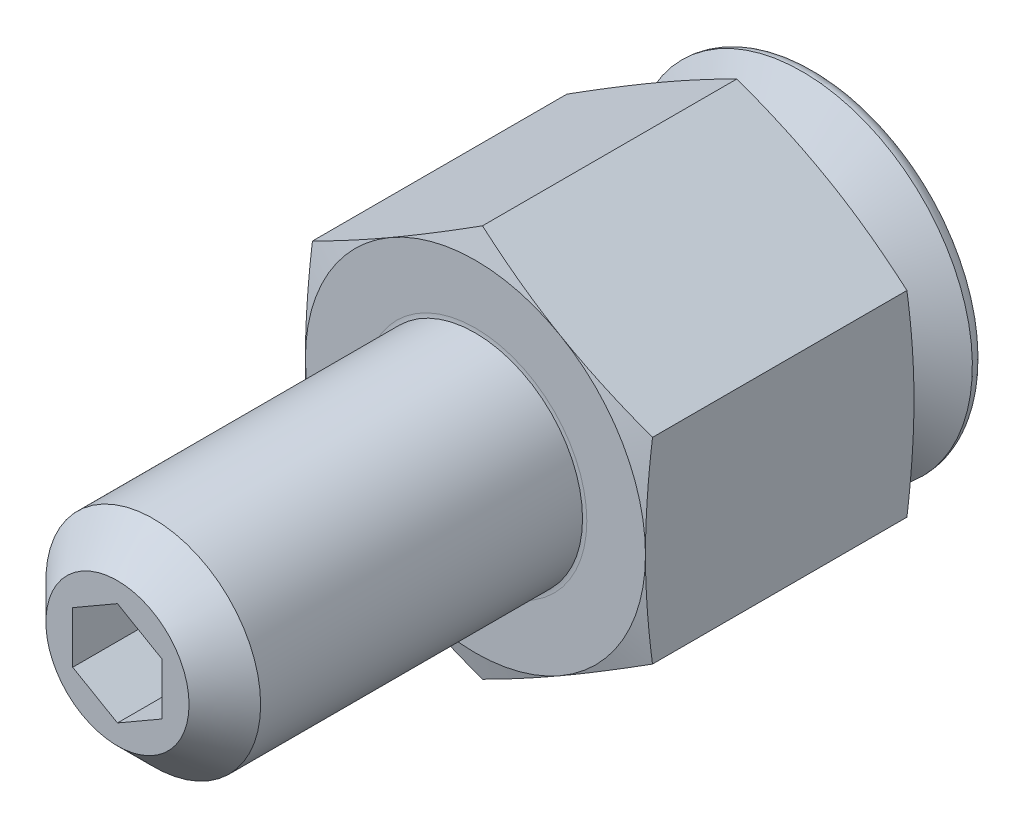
ISO-10303-21;
HEADER;
FILE_DESCRIPTION(('STEP AP214'),'2;1');
FILE_NAME('part.step','',(''),(''),'','','');
FILE_SCHEMA(('AUTOMOTIVE_DESIGN { 1 0 10303 214 1 1 1 1 }'));
ENDSEC;
DATA;
#1=APPLICATION_CONTEXT('core data for automotive mechanical design processes');
#2=APPLICATION_PROTOCOL_DEFINITION('international standard','automotive_design',2000,#1);
#3=PRODUCT_CONTEXT('',#1,'mechanical');
#4=PRODUCT('Part','Part','',(#3));
#5=PRODUCT_RELATED_PRODUCT_CATEGORY('part','',(#4));
#6=PRODUCT_DEFINITION_FORMATION('','',#4);
#7=PRODUCT_DEFINITION_CONTEXT('part definition',#1,'design');
#8=PRODUCT_DEFINITION('design','',#6,#7);
#9=PRODUCT_DEFINITION_SHAPE('','',#8);
#10=(LENGTH_UNIT() NAMED_UNIT(*) SI_UNIT(.MILLI.,.METRE.));
#11=(NAMED_UNIT(*) PLANE_ANGLE_UNIT() SI_UNIT($,.RADIAN.));
#12=(NAMED_UNIT(*) SI_UNIT($,.STERADIAN.) SOLID_ANGLE_UNIT());
#13=UNCERTAINTY_MEASURE_WITH_UNIT(LENGTH_MEASURE(1.E-05),#10,'distance_accuracy_value','');
#14=(GEOMETRIC_REPRESENTATION_CONTEXT(3) GLOBAL_UNCERTAINTY_ASSIGNED_CONTEXT((#13)) GLOBAL_UNIT_ASSIGNED_CONTEXT((#10,
#11,#12)) REPRESENTATION_CONTEXT('',''));
#15=CARTESIAN_POINT('',(0.,0.,0.));
#16=DIRECTION('',(0.,0.,1.));
#17=DIRECTION('',(1.,0.,0.));
#18=AXIS2_PLACEMENT_3D('',#15,#16,#17);
#19=CARTESIAN_POINT('',(0.,0.,6.775599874));
#20=DIRECTION('',(0.,0.,-1.));
#21=DIRECTION('',(-0.24616653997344,0.969227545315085,0.));
#22=AXIS2_PLACEMENT_3D('',#19,#20,#21);
#23=SPHERICAL_SURFACE('',#22,7.5);
#24=CARTESIAN_POINT('',(0.,0.,4.9143998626));
#25=DIRECTION('',(0.,0.,-1.));
#26=DIRECTION('',(0.24616653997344,-0.969227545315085,0.));
#27=AXIS2_PLACEMENT_3D('',#24,#25,#26);
#28=CIRCLE('',#27,7.26539293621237);
#29=CARTESIAN_POINT('',(-1.78849664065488,7.04181896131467,4.9143998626));
#30=VERTEX_POINT('',#29);
#31=EDGE_CURVE('E9',#30,#30,#28,.F.);
#32=CARTESIAN_POINT('',(0.,0.,3.78746603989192));
#33=DIRECTION('',(0.,0.,1.));
#34=DIRECTION('',(-0.24616653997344,0.969227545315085,0.));
#35=AXIS2_PLACEMENT_3D('',#32,#33,#34);
#36=CIRCLE('',#35,6.87903017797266);
#37=CARTESIAN_POINT('',(-1.69338705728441,6.66734553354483,3.78746603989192));
#38=VERTEX_POINT('',#37);
#39=EDGE_CURVE('E358',#38,#38,#36,.T.);
#40=CARTESIAN_POINT('',(-1.78849664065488,7.04181896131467,4.9143998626));
#41=CARTESIAN_POINT('',(-1.78773775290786,7.03883100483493,4.90236573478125));
#42=CARTESIAN_POINT('',(-1.78697150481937,7.03581406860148,4.89033926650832));
#43=CARTESIAN_POINT('',(-1.78542430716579,7.02972231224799,4.86630194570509));
#44=CARTESIAN_POINT('',(-1.78464335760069,7.02664749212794,4.85429109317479));
#45=CARTESIAN_POINT('',(-1.78306677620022,7.02044004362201,4.83028530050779));
#46=CARTESIAN_POINT('',(-1.78227114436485,7.01730741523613,4.81829036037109));
#47=CARTESIAN_POINT('',(-1.78066521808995,7.0109844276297,4.79431668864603));
#48=CARTESIAN_POINT('',(-1.77985492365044,7.00779406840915,4.78233795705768));
#49=CARTESIAN_POINT('',(-1.77821969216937,7.00135569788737,4.75839699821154));
#50=CARTESIAN_POINT('',(-1.77739475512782,6.99810768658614,4.74643477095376));
#51=CARTESIAN_POINT('',(-1.77573025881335,6.99155409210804,4.72252711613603));
#52=CARTESIAN_POINT('',(-1.77489069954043,6.98824850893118,4.7105816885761));
#53=CARTESIAN_POINT('',(-1.77319697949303,6.98157985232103,4.68670792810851));
#54=CARTESIAN_POINT('',(-1.77234281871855,6.97821677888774,4.67477959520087));
#55=CARTESIAN_POINT('',(-1.77061991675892,6.97143322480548,4.6509403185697));
#56=CARTESIAN_POINT('',(-1.76975117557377,6.96801274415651,4.63902937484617));
#57=CARTESIAN_POINT('',(-1.76799913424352,6.96111446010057,4.61522517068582));
#58=CARTESIAN_POINT('',(-1.76711583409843,6.95763665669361,4.603331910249));
#59=CARTESIAN_POINT('',(-1.76533469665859,6.95062381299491,4.57956336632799));
#60=CARTESIAN_POINT('',(-1.76443685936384,6.94708877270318,4.5676880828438));
#61=CARTESIAN_POINT('',(-1.7626266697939,6.93996154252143,4.5439557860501));
#62=CARTESIAN_POINT('',(-1.7617143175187,6.93636935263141,4.53209877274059));
#63=CARTESIAN_POINT('',(-1.75987512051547,6.92912791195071,4.50840330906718));
#64=CARTESIAN_POINT('',(-1.75894827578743,6.92547866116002,4.49656485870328));
#65=CARTESIAN_POINT('',(-1.75708011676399,6.91812318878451,4.47290681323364));
#66=CARTESIAN_POINT('',(-1.75613880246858,6.9144169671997,4.46108721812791));
#67=CARTESIAN_POINT('',(-1.75424172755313,6.90694764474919,4.43746717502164));
#68=CARTESIAN_POINT('',(-1.75328596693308,6.90318454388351,4.42566672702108));
#69=CARTESIAN_POINT('',(-1.7513600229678,6.89560155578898,4.40208526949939));
#70=CARTESIAN_POINT('',(-1.75038983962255,6.89178166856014,4.39030425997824));
#71=CARTESIAN_POINT('',(-1.74843507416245,6.88408520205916,4.3667619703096));
#72=CARTESIAN_POINT('',(-1.74745049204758,6.88020862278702,4.3550006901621));
#73=CARTESIAN_POINT('',(-1.74546695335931,6.87239886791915,4.33149814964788));
#74=CARTESIAN_POINT('',(-1.74446799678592,6.86846569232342,4.31975688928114));
#75=CARTESIAN_POINT('',(-1.74245573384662,6.86054284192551,4.29629467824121));
#76=CARTESIAN_POINT('',(-1.74144242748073,6.85655316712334,4.28457372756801));
#77=CARTESIAN_POINT('',(-1.73940148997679,6.84851741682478,4.26115242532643));
#78=CARTESIAN_POINT('',(-1.73837385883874,6.8444713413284,4.24945207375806));
#79=CARTESIAN_POINT('',(-1.73630429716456,6.83632288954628,4.2260722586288));
#80=CARTESIAN_POINT('',(-1.73526236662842,6.83222051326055,4.21439279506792));
#81=CARTESIAN_POINT('',(-1.73316423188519,6.82395956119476,4.19105504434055));
#82=CARTESIAN_POINT('',(-1.7321080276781,6.8198009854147,4.17939675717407));
#83=CARTESIAN_POINT('',(-1.72998137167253,6.81142773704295,4.1561016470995));
#84=CARTESIAN_POINT('',(-1.72891091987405,6.80721306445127,4.14446482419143));
#85=CARTESIAN_POINT('',(-1.72675579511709,6.79872772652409,4.12121292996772));
#86=CARTESIAN_POINT('',(-1.7256711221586,6.7944570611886,4.10959785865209));
#87=CARTESIAN_POINT('',(-1.72348758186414,6.78585984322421,4.08638975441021));
#88=CARTESIAN_POINT('',(-1.72238871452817,6.7815332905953,4.07479672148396));
#89=CARTESIAN_POINT('',(-1.72017681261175,6.77282440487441,4.05163298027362));
#90=CARTESIAN_POINT('',(-1.71906377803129,6.76844207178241,4.04006227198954));
#91=CARTESIAN_POINT('',(-1.71682356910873,6.75962173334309,4.01694346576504));
#92=CARTESIAN_POINT('',(-1.71569639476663,6.75518372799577,4.00539536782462));
#93=CARTESIAN_POINT('',(-1.71342793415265,6.74625215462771,3.98232206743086));
#94=CARTESIAN_POINT('',(-1.71228664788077,6.74175858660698,3.97079686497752));
#95=CARTESIAN_POINT('',(-1.709989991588,6.73271599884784,3.94776964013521));
#96=CARTESIAN_POINT('',(-1.70883462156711,6.72816697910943,3.93626761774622));
#97=CARTESIAN_POINT('',(-1.70650982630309,6.71901360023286,3.91328703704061));
#98=CARTESIAN_POINT('',(-1.70534040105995,6.71440924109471,3.90180847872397));
#99=CARTESIAN_POINT('',(-1.70298752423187,6.70514529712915,3.87887510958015));
#100=CARTESIAN_POINT('',(-1.70180407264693,6.70048571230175,3.86742029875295));
#101=CARTESIAN_POINT('',(-1.69942317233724,6.6911114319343,3.84453470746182));
#102=CARTESIAN_POINT('',(-1.6982257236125,6.68639673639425,3.83310392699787));
#103=CARTESIAN_POINT('',(-1.69581685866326,6.67691235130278,3.81026667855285));
#104=CARTESIAN_POINT('',(-1.69460544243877,6.67214266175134,3.79886021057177));
#105=CARTESIAN_POINT('',(-1.69338705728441,6.66734553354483,3.78746603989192));
#106=B_SPLINE_CURVE_WITH_KNOTS('',3,(#40,#41,#42,#43,#44,#45,#46,#47,#48,#49,#50,#51,#52,#53,
#54,#55,#56,#57,#58,#59,#60,#61,#62,#63,#64,#65,#66,#67,#68,#69,#70,#71,#72,#73,#74,#75,#76,#77,
#78,#79,#80,#81,#82,#83,#84,#85,#86,#87,#88,#89,#90,#91,#92,#93,#94,#95,#96,#97,#98,#99,#100,
#101,#102,#103,#104,#105),.UNSPECIFIED.,.F.,.F.,(4,2,2,2,2,2,2,2,2,2,2,2,2,2,2,2,2,2,2,2,2,2,2,
2,2,2,2,2,2,2,2,2,4),(0.,0.0372681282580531,0.0745362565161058,0.111804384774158,
0.149072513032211,0.186340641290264,0.223608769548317,0.260876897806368,0.298145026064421,
0.335413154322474,0.372681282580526,0.409949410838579,0.447217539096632,0.484485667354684,
0.521753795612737,0.55902192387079,0.596290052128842,0.633558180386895,0.670826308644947,
0.708094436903,0.745362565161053,0.782630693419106,0.819898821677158,0.857166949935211,
0.894435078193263,0.931703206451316,0.968971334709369,1.00623946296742,1.04350759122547,
1.08077571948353,1.11804384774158,1.15531197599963,1.19258010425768),.UNSPECIFIED.);
#107=EDGE_CURVE('BSEAM14',#30,#38,#106,.T.);
#108=ORIENTED_EDGE('',*,*,#31,.F.);
#109=ORIENTED_EDGE('',*,*,#39,.T.);
#110=ORIENTED_EDGE('',*,*,#107,.T.);
#111=ORIENTED_EDGE('',*,*,#107,.F.);
#112=EDGE_LOOP('',(#108,#110,#109,#111));
#113=FACE_BOUND('',#112,.T.);
#114=ADVANCED_FACE('F14',(#113),#23,.T.);
#115=CARTESIAN_POINT('',(0.,0.,0.));
#116=DIRECTION('',(0.,0.,-1.));
#117=DIRECTION('',(0.24616653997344,-0.969227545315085,0.));
#118=AXIS2_PLACEMENT_3D('',#115,#116,#117);
#119=CYLINDRICAL_SURFACE('',#118,6.858);
#120=CARTESIAN_POINT('',(0.,0.,3.68626790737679));
#121=DIRECTION('',(0.,0.,1.));
#122=DIRECTION('',(-0.24616653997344,0.969227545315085,0.));
#123=AXIS2_PLACEMENT_3D('',#120,#121,#122);
#124=CIRCLE('',#123,6.858);
#125=CARTESIAN_POINT('',(-1.68821013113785,6.64696250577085,3.68626790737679));
#126=VERTEX_POINT('',#125);
#127=EDGE_CURVE('E356',#126,#126,#124,.F.);
#128=ORIENTED_EDGE('',*,*,#127,.T.);
#129=EDGE_LOOP('',(#128));
#130=FACE_BOUND('',#129,.T.);
#131=CARTESIAN_POINT('',(0.,0.,2.43400637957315));
#132=DIRECTION('',(0.,0.,-1.));
#133=DIRECTION('',(0.24616653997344,-0.969227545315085,0.));
#134=AXIS2_PLACEMENT_3D('',#131,#132,#133);
#135=CIRCLE('',#134,6.858);
#136=CARTESIAN_POINT('',(1.68821013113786,-6.64696250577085,2.43400637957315));
#137=VERTEX_POINT('',#136);
#138=EDGE_CURVE('E353',#137,#137,#135,.F.);
#139=ORIENTED_EDGE('',*,*,#138,.T.);
#140=EDGE_LOOP('',(#139));
#141=FACE_BOUND('',#140,.T.);
#142=ADVANCED_FACE('F377',(#130,#141),#119,.T.);
#143=CARTESIAN_POINT('',(0.,0.,2.28735941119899));
#144=DIRECTION('',(0.,0.,-1.));
#145=DIRECTION('',(0.24616653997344,-0.969227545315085,0.));
#146=AXIS2_PLACEMENT_3D('',#143,#144,#145);
#147=CONICAL_SURFACE('',#146,6.858,1.0471975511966);
#148=CARTESIAN_POINT('',(0.,0.,2.2140359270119));
#149=DIRECTION('',(0.,0.,-1.));
#150=DIRECTION('',(0.24616653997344,-0.969227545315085,0.));
#151=AXIS2_PLACEMENT_3D('',#148,#149,#150);
#152=CIRCLE('',#151,6.985);
#153=CARTESIAN_POINT('',(1.71947328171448,-6.77005440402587,2.2140359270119));
#154=VERTEX_POINT('',#153);
#155=EDGE_CURVE('E18',#154,#154,#152,.T.);
#156=ORIENTED_EDGE('',*,*,#155,.T.);
#157=EDGE_LOOP('',(#156));
#158=FACE_BOUND('',#157,.T.);
#159=CARTESIAN_POINT('',(0.,0.,0.762));
#160=DIRECTION('',(0.,0.,-1.));
#161=DIRECTION('',(0.24616653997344,-0.969227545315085,0.));
#162=AXIS2_PLACEMENT_3D('',#159,#160,#161);
#163=CIRCLE('',#162,9.5);
#164=CARTESIAN_POINT('',(2.33858212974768,-9.20766168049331,0.762));
#165=VERTEX_POINT('',#164);
#166=EDGE_CURVE('E347',#165,#165,#163,.T.);
#167=ORIENTED_EDGE('',*,*,#166,.F.);
#168=EDGE_LOOP('',(#167));
#169=FACE_BOUND('',#168,.T.);
#170=ADVANCED_FACE('F383',(#158,#169),#147,.T.);
#171=CARTESIAN_POINT('',(-2.33858212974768,9.2076616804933,0.));
#172=DIRECTION('',(0.,0.,1.));
#173=DIRECTION('',(-0.24616653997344,0.969227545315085,0.));
#174=AXIS2_PLACEMENT_3D('',#171,#172,#173);
#175=PLANE('',#174);
#176=CARTESIAN_POINT('',(0.,0.,0.));
#177=DIRECTION('',(0.,0.,1.));
#178=DIRECTION('',(-0.24616653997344,0.969227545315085,0.));
#179=AXIS2_PLACEMENT_3D('',#176,#177,#178);
#180=CIRCLE('',#179,8.738);
#181=CARTESIAN_POINT('',(-2.15100322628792,8.46911029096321,0.));
#182=VERTEX_POINT('',#181);
#183=EDGE_CURVE('E350',#182,#182,#180,.F.);
#184=ORIENTED_EDGE('',*,*,#183,.T.);
#185=EDGE_LOOP('',(#184));
#186=FACE_BOUND('',#185,.T.);
#187=ADVANCED_FACE('F491',(#186),#175,.F.);
#188=CARTESIAN_POINT('',(0.,0.,0.762));
#189=DIRECTION('',(0.,0.,1.));
#190=DIRECTION('',(-0.24616653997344,0.969227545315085,0.));
#191=AXIS2_PLACEMENT_3D('',#188,#189,#190);
#192=TOROIDAL_SURFACE('',#191,8.738,0.762);
#193=ORIENTED_EDGE('',*,*,#166,.T.);
#194=EDGE_LOOP('',(#193));
#195=FACE_BOUND('',#194,.T.);
#196=ORIENTED_EDGE('',*,*,#183,.F.);
#197=EDGE_LOOP('',(#196));
#198=FACE_BOUND('',#197,.T.);
#199=ADVANCED_FACE('F494',(#195,#198),#192,.T.);
#200=CARTESIAN_POINT('',(0.,0.,3.68626790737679));
#201=DIRECTION('',(0.,0.,1.));
#202=DIRECTION('',(-0.24616653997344,0.969227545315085,0.));
#203=AXIS2_PLACEMENT_3D('',#200,#201,#202);
#204=TOROIDAL_SURFACE('',#203,7.112,0.254);
#205=ORIENTED_EDGE('',*,*,#39,.F.);
#206=EDGE_LOOP('',(#205));
#207=FACE_BOUND('',#206,.T.);
#208=ORIENTED_EDGE('',*,*,#127,.F.);
#209=EDGE_LOOP('',(#208));
#210=FACE_BOUND('',#209,.T.);
#211=ADVANCED_FACE('F395',(#207,#210),#204,.F.);
#212=CARTESIAN_POINT('',(0.,0.,2.43400637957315));
#213=DIRECTION('',(0.,0.,-1.));
#214=DIRECTION('',(0.24616653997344,-0.969227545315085,0.));
#215=AXIS2_PLACEMENT_3D('',#212,#213,#214);
#216=TOROIDAL_SURFACE('',#215,7.112,0.254);
#217=ORIENTED_EDGE('',*,*,#138,.F.);
#218=EDGE_LOOP('',(#217));
#219=FACE_BOUND('',#218,.T.);
#220=ORIENTED_EDGE('',*,*,#155,.F.);
#221=EDGE_LOOP('',(#220));
#222=FACE_BOUND('',#221,.T.);
#223=ADVANCED_FACE('F16',(#219,#222),#216,.F.);
#224=CARTESIAN_POINT('',(5.,0.,34.0253998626));
#225=DIRECTION('',(0.,0.,-1.));
#226=DIRECTION('',(-1.,0.,0.));
#227=AXIS2_PLACEMENT_3D('',#224,#225,#226);
#228=PLANE('',#227);
#229=DIRECTION('',(-0.866025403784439,0.5,0.));
#230=VECTOR('',#229,1.);
#231=CARTESIAN_POINT('',(2.5,1.44337567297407,34.0253998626));
#232=LINE('',#231,#230);
#233=CARTESIAN_POINT('',(2.5,1.44337567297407,34.0253998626));
#234=VERTEX_POINT('',#233);
#235=CARTESIAN_POINT('',(0.,2.88675134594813,34.0253998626));
#236=VERTEX_POINT('',#235);
#237=EDGE_CURVE('E143',#234,#236,#232,.T.);
#238=ORIENTED_EDGE('',*,*,#237,.T.);
#239=DIRECTION('',(-0.866025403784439,-0.5,0.));
#240=VECTOR('',#239,1.);
#241=CARTESIAN_POINT('',(0.,2.88675134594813,34.0253998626));
#242=LINE('',#241,#240);
#243=CARTESIAN_POINT('',(-2.5,1.44337567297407,34.0253998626));
#244=VERTEX_POINT('',#243);
#245=EDGE_CURVE('E152',#236,#244,#242,.T.);
#246=ORIENTED_EDGE('',*,*,#245,.T.);
#247=DIRECTION('',(0.,-1.,0.));
#248=VECTOR('',#247,1.);
#249=CARTESIAN_POINT('',(-2.5,1.44337567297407,34.0253998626));
#250=LINE('',#249,#248);
#251=CARTESIAN_POINT('',(-2.5,-1.44337567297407,34.0253998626));
#252=VERTEX_POINT('',#251);
#253=EDGE_CURVE('E157',#244,#252,#250,.T.);
#254=ORIENTED_EDGE('',*,*,#253,.T.);
#255=DIRECTION('',(0.866025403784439,-0.5,0.));
#256=VECTOR('',#255,1.);
#257=CARTESIAN_POINT('',(-2.5,-1.44337567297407,34.0253998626));
#258=LINE('',#257,#256);
#259=CARTESIAN_POINT('',(0.,-2.88675134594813,34.0253998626));
#260=VERTEX_POINT('',#259);
#261=EDGE_CURVE('E171',#252,#260,#258,.T.);
#262=ORIENTED_EDGE('',*,*,#261,.T.);
#263=DIRECTION('',(0.866025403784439,0.5,0.));
#264=VECTOR('',#263,1.);
#265=CARTESIAN_POINT('',(0.,-2.88675134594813,34.0253998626));
#266=LINE('',#265,#264);
#267=CARTESIAN_POINT('',(2.5,-1.44337567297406,34.0253998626));
#268=VERTEX_POINT('',#267);
#269=EDGE_CURVE('E174',#260,#268,#266,.T.);
#270=ORIENTED_EDGE('',*,*,#269,.T.);
#271=DIRECTION('',(0.,1.,0.));
#272=VECTOR('',#271,1.);
#273=CARTESIAN_POINT('',(2.5,-1.44337567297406,34.0253998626));
#274=LINE('',#273,#272);
#275=EDGE_CURVE('E149',#268,#234,#274,.T.);
#276=ORIENTED_EDGE('',*,*,#275,.T.);
#277=EDGE_LOOP('',(#238,#246,#254,#262,#270,#276));
#278=FACE_BOUND('',#277,.T.);
#279=ADVANCED_FACE('F159',(#278),#228,.F.);
#280=CARTESIAN_POINT('',(0.,2.88675134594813,34.0253998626));
#281=DIRECTION('',(-0.5,0.866025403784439,0.));
#282=DIRECTION('',(0.866025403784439,0.5,0.));
#283=AXIS2_PLACEMENT_3D('',#280,#281,#282);
#284=PLANE('',#283);
#285=DIRECTION('',(-0.866025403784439,-0.5,0.));
#286=VECTOR('',#285,1.);
#287=CARTESIAN_POINT('',(0.,2.88675134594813,39.0253998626));
#288=LINE('',#287,#286);
#289=CARTESIAN_POINT('',(0.,2.88675134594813,39.0253998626));
#290=VERTEX_POINT('',#289);
#291=CARTESIAN_POINT('',(-2.5,1.44337567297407,39.0253998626));
#292=VERTEX_POINT('',#291);
#293=EDGE_CURVE('E178',#290,#292,#288,.T.);
#294=ORIENTED_EDGE('',*,*,#293,.T.);
#295=DIRECTION('',(0.,0.,1.));
#296=VECTOR('',#295,1.);
#297=CARTESIAN_POINT('',(-2.5,1.44337567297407,34.0253998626));
#298=LINE('',#297,#296);
#299=EDGE_CURVE('E148',#244,#292,#298,.T.);
#300=ORIENTED_EDGE('',*,*,#299,.F.);
#301=ORIENTED_EDGE('',*,*,#245,.F.);
#302=DIRECTION('',(0.,0.,1.));
#303=VECTOR('',#302,1.);
#304=CARTESIAN_POINT('',(0.,2.88675134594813,34.0253998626));
#305=LINE('',#304,#303);
#306=EDGE_CURVE('E139',#236,#290,#305,.T.);
#307=ORIENTED_EDGE('',*,*,#306,.T.);
#308=EDGE_LOOP('',(#294,#300,#301,#307));
#309=FACE_BOUND('',#308,.T.);
#310=ADVANCED_FACE('F153',(#309),#284,.F.);
#311=CARTESIAN_POINT('',(-2.5,1.44337567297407,34.0253998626));
#312=DIRECTION('',(-1.,0.,0.));
#313=DIRECTION('',(0.,0.,1.));
#314=AXIS2_PLACEMENT_3D('',#311,#312,#313);
#315=PLANE('',#314);
#316=DIRECTION('',(0.,-1.,0.));
#317=VECTOR('',#316,1.);
#318=CARTESIAN_POINT('',(-2.5,1.44337567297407,39.0253998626));
#319=LINE('',#318,#317);
#320=CARTESIAN_POINT('',(-2.5,-1.44337567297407,39.0253998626));
#321=VERTEX_POINT('',#320);
#322=EDGE_CURVE('E180',#292,#321,#319,.T.);
#323=ORIENTED_EDGE('',*,*,#322,.T.);
#324=DIRECTION('',(0.,0.,1.));
#325=VECTOR('',#324,1.);
#326=CARTESIAN_POINT('',(-2.5,-1.44337567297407,34.0253998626));
#327=LINE('',#326,#325);
#328=EDGE_CURVE('E195',#252,#321,#327,.T.);
#329=ORIENTED_EDGE('',*,*,#328,.F.);
#330=ORIENTED_EDGE('',*,*,#253,.F.);
#331=ORIENTED_EDGE('',*,*,#299,.T.);
#332=EDGE_LOOP('',(#323,#329,#330,#331));
#333=FACE_BOUND('',#332,.T.);
#334=ADVANCED_FACE('F393',(#333),#315,.F.);
#335=CARTESIAN_POINT('',(-2.5,-1.44337567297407,34.0253998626));
#336=DIRECTION('',(-0.5,-0.866025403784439,0.));
#337=DIRECTION('',(-0.866025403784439,0.5,0.));
#338=AXIS2_PLACEMENT_3D('',#335,#336,#337);
#339=PLANE('',#338);
#340=DIRECTION('',(0.866025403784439,-0.5,0.));
#341=VECTOR('',#340,1.);
#342=CARTESIAN_POINT('',(-2.5,-1.44337567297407,39.0253998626));
#343=LINE('',#342,#341);
#344=CARTESIAN_POINT('',(0.,-2.88675134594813,39.0253998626));
#345=VERTEX_POINT('',#344);
#346=EDGE_CURVE('E183',#321,#345,#343,.T.);
#347=ORIENTED_EDGE('',*,*,#346,.T.);
#348=DIRECTION('',(0.,0.,1.));
#349=VECTOR('',#348,1.);
#350=CARTESIAN_POINT('',(0.,-2.88675134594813,34.0253998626));
#351=LINE('',#350,#349);
#352=EDGE_CURVE('E193',#260,#345,#351,.T.);
#353=ORIENTED_EDGE('',*,*,#352,.F.);
#354=ORIENTED_EDGE('',*,*,#261,.F.);
#355=ORIENTED_EDGE('',*,*,#328,.T.);
#356=EDGE_LOOP('',(#347,#353,#354,#355));
#357=FACE_BOUND('',#356,.T.);
#358=ADVANCED_FACE('F405',(#357),#339,.F.);
#359=CARTESIAN_POINT('',(0.,-2.88675134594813,34.0253998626));
#360=DIRECTION('',(0.5,-0.866025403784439,0.));
#361=DIRECTION('',(-0.866025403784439,-0.5,0.));
#362=AXIS2_PLACEMENT_3D('',#359,#360,#361);
#363=PLANE('',#362);
#364=DIRECTION('',(0.866025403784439,0.5,0.));
#365=VECTOR('',#364,1.);
#366=CARTESIAN_POINT('',(0.,-2.88675134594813,39.0253998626));
#367=LINE('',#366,#365);
#368=CARTESIAN_POINT('',(2.5,-1.44337567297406,39.0253998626));
#369=VERTEX_POINT('',#368);
#370=EDGE_CURVE('E165',#345,#369,#367,.T.);
#371=ORIENTED_EDGE('',*,*,#370,.T.);
#372=DIRECTION('',(0.,0.,1.));
#373=VECTOR('',#372,1.);
#374=CARTESIAN_POINT('',(2.5,-1.44337567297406,34.0253998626));
#375=LINE('',#374,#373);
#376=EDGE_CURVE('E191',#268,#369,#375,.T.);
#377=ORIENTED_EDGE('',*,*,#376,.F.);
#378=ORIENTED_EDGE('',*,*,#269,.F.);
#379=ORIENTED_EDGE('',*,*,#352,.T.);
#380=EDGE_LOOP('',(#371,#377,#378,#379));
#381=FACE_BOUND('',#380,.T.);
#382=ADVANCED_FACE('F401',(#381),#363,.F.);
#383=CARTESIAN_POINT('',(2.5,-1.44337567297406,34.0253998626));
#384=DIRECTION('',(1.,0.,0.));
#385=DIRECTION('',(0.,0.,-1.));
#386=AXIS2_PLACEMENT_3D('',#383,#384,#385);
#387=PLANE('',#386);
#388=DIRECTION('',(0.,1.,0.));
#389=VECTOR('',#388,1.);
#390=CARTESIAN_POINT('',(2.5,-1.44337567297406,39.0253998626));
#391=LINE('',#390,#389);
#392=CARTESIAN_POINT('',(2.5,1.44337567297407,39.0253998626));
#393=VERTEX_POINT('',#392);
#394=EDGE_CURVE('E162',#369,#393,#391,.T.);
#395=ORIENTED_EDGE('',*,*,#394,.T.);
#396=DIRECTION('',(0.,0.,1.));
#397=VECTOR('',#396,1.);
#398=CARTESIAN_POINT('',(2.5,1.44337567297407,34.0253998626));
#399=LINE('',#398,#397);
#400=EDGE_CURVE('E188',#234,#393,#399,.T.);
#401=ORIENTED_EDGE('',*,*,#400,.F.);
#402=ORIENTED_EDGE('',*,*,#275,.F.);
#403=ORIENTED_EDGE('',*,*,#376,.T.);
#404=EDGE_LOOP('',(#395,#401,#402,#403));
#405=FACE_BOUND('',#404,.T.);
#406=ADVANCED_FACE('F398',(#405),#387,.F.);
#407=CARTESIAN_POINT('',(2.5,1.44337567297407,34.0253998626));
#408=DIRECTION('',(0.5,0.866025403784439,0.));
#409=DIRECTION('',(0.866025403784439,-0.5,0.));
#410=AXIS2_PLACEMENT_3D('',#407,#408,#409);
#411=PLANE('',#410);
#412=DIRECTION('',(-0.866025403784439,0.5,0.));
#413=VECTOR('',#412,1.);
#414=CARTESIAN_POINT('',(2.5,1.44337567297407,39.0253998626));
#415=LINE('',#414,#413);
#416=EDGE_CURVE('E31',#393,#290,#415,.T.);
#417=ORIENTED_EDGE('',*,*,#416,.T.);
#418=ORIENTED_EDGE('',*,*,#306,.F.);
#419=ORIENTED_EDGE('',*,*,#237,.F.);
#420=ORIENTED_EDGE('',*,*,#400,.T.);
#421=EDGE_LOOP('',(#417,#418,#419,#420));
#422=FACE_BOUND('',#421,.T.);
#423=ADVANCED_FACE('F141',(#422),#411,.F.);
#424=CARTESIAN_POINT('',(0.,0.,39.0253998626));
#425=DIRECTION('',(0.,0.,1.));
#426=DIRECTION('',(1.,0.,0.));
#427=AXIS2_PLACEMENT_3D('',#424,#425,#426);
#428=PLANE('',#427);
#429=ORIENTED_EDGE('',*,*,#416,.F.);
#430=ORIENTED_EDGE('',*,*,#394,.F.);
#431=ORIENTED_EDGE('',*,*,#370,.F.);
#432=ORIENTED_EDGE('',*,*,#346,.F.);
#433=ORIENTED_EDGE('',*,*,#322,.F.);
#434=ORIENTED_EDGE('',*,*,#293,.F.);
#435=EDGE_LOOP('',(#429,#430,#431,#432,#433,#434));
#436=FACE_BOUND('',#435,.T.);
#437=CARTESIAN_POINT('',(0.,0.,39.0253998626));
#438=DIRECTION('',(0.,0.,1.));
#439=DIRECTION('',(1.,0.,0.));
#440=AXIS2_PLACEMENT_3D('',#437,#438,#439);
#441=CIRCLE('',#440,4.);
#442=CARTESIAN_POINT('',(4.,0.,39.0253998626));
#443=VERTEX_POINT('',#442);
#444=EDGE_CURVE('E342',#443,#443,#441,.T.);
#445=ORIENTED_EDGE('',*,*,#444,.T.);
#446=EDGE_LOOP('',(#445));
#447=FACE_BOUND('',#446,.T.);
#448=ADVANCED_FACE('F415',(#436,#447),#428,.T.);
#449=CARTESIAN_POINT('',(0.,0.,39.0253998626));
#450=DIRECTION('',(0.,0.,-1.));
#451=DIRECTION('',(-1.,0.,0.));
#452=AXIS2_PLACEMENT_3D('',#449,#450,#451);
#453=CONICAL_SURFACE('',#452,4.,0.785398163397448);
#454=CARTESIAN_POINT('',(0.,0.,37.0253998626));
#455=DIRECTION('',(0.,0.,1.));
#456=DIRECTION('',(1.,0.,0.));
#457=AXIS2_PLACEMENT_3D('',#454,#455,#456);
#458=CIRCLE('',#457,6.);
#459=CARTESIAN_POINT('',(6.,0.,37.0253998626));
#460=VERTEX_POINT('',#459);
#461=EDGE_CURVE('E23',#460,#460,#458,.F.);
#462=ORIENTED_EDGE('',*,*,#461,.F.);
#463=EDGE_LOOP('',(#462));
#464=FACE_BOUND('',#463,.T.);
#465=ORIENTED_EDGE('',*,*,#444,.F.);
#466=EDGE_LOOP('',(#465));
#467=FACE_BOUND('',#466,.T.);
#468=ADVANCED_FACE('F417',(#464,#467),#453,.T.);
#469=CARTESIAN_POINT('',(0.,0.,39.0253998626));
#470=DIRECTION('',(0.,0.,-1.));
#471=DIRECTION('',(-1.,0.,0.));
#472=AXIS2_PLACEMENT_3D('',#469,#470,#471);
#473=CYLINDRICAL_SURFACE('',#472,6.);
#474=ORIENTED_EDGE('',*,*,#461,.T.);
#475=EDGE_LOOP('',(#474));
#476=FACE_BOUND('',#475,.T.);
#477=CARTESIAN_POINT('',(0.,0.,19.0418034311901));
#478=DIRECTION('',(0.,0.,1.));
#479=DIRECTION('',(1.,0.,0.));
#480=AXIS2_PLACEMENT_3D('',#477,#478,#479);
#481=CIRCLE('',#480,6.);
#482=CARTESIAN_POINT('',(6.,0.,19.0418034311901));
#483=VERTEX_POINT('',#482);
#484=EDGE_CURVE('E190',#483,#483,#481,.F.);
#485=ORIENTED_EDGE('',*,*,#484,.F.);
#486=EDGE_LOOP('',(#485));
#487=FACE_BOUND('',#486,.T.);
#488=ADVANCED_FACE('F419',(#476,#487),#473,.T.);
#489=CARTESIAN_POINT('',(0.,0.,20.5493998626));
#490=DIRECTION('',(0.,0.,-1.));
#491=DIRECTION('',(-1.,0.,0.));
#492=AXIS2_PLACEMENT_3D('',#489,#490,#491);
#493=TOROIDAL_SURFACE('',#492,6.223,1.524);
#494=ORIENTED_EDGE('',*,*,#484,.T.);
#495=EDGE_LOOP('',(#494));
#496=FACE_BOUND('',#495,.T.);
#497=CARTESIAN_POINT('',(0.,0.,19.0253998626));
#498=DIRECTION('',(0.,0.,-1.));
#499=DIRECTION('',(-1.,0.,0.));
#500=AXIS2_PLACEMENT_3D('',#497,#498,#499);
#501=CIRCLE('',#500,6.223);
#502=CARTESIAN_POINT('',(-6.223,0.,19.0253998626));
#503=VERTEX_POINT('',#502);
#504=EDGE_CURVE('E339',#503,#503,#501,.T.);
#505=ORIENTED_EDGE('',*,*,#504,.F.);
#506=EDGE_LOOP('',(#505));
#507=FACE_BOUND('',#506,.T.);
#508=ADVANCED_FACE('F421',(#496,#507),#493,.F.);
#509=CARTESIAN_POINT('',(-9.5,16.4544826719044,19.0253998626));
#510=DIRECTION('',(0.,0.,-1.));
#511=DIRECTION('',(-1.,0.,0.));
#512=AXIS2_PLACEMENT_3D('',#509,#510,#511);
#513=PLANE('',#512);
#514=CARTESIAN_POINT('',(0.,0.,19.0253998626));
#515=DIRECTION('',(0.,0.,-1.));
#516=DIRECTION('',(-1.,0.,0.));
#517=AXIS2_PLACEMENT_3D('',#514,#515,#516);
#518=CIRCLE('',#517,9.5);
#519=CARTESIAN_POINT('',(-9.5,0.,19.0253998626));
#520=VERTEX_POINT('',#519);
#521=CARTESIAN_POINT('',(-4.75,8.22724133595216,19.0253998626));
#522=VERTEX_POINT('',#521);
#523=EDGE_CURVE('E451',#520,#522,#518,.T.);
#524=ORIENTED_EDGE('',*,*,#523,.F.);
#525=CARTESIAN_POINT('',(0.,0.,19.0253998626));
#526=DIRECTION('',(0.,0.,-1.));
#527=DIRECTION('',(-1.,0.,0.));
#528=AXIS2_PLACEMENT_3D('',#525,#526,#527);
#529=CIRCLE('',#528,9.5);
#530=CARTESIAN_POINT('',(-4.75,-8.22724133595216,19.0253998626));
#531=VERTEX_POINT('',#530);
#532=EDGE_CURVE('E308',#531,#520,#529,.T.);
#533=ORIENTED_EDGE('',*,*,#532,.F.);
#534=CARTESIAN_POINT('',(4.75,-8.22724133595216,19.0253998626));
#535=VERTEX_POINT('',#534);
#536=EDGE_CURVE('E326',#535,#531,#529,.T.);
#537=ORIENTED_EDGE('',*,*,#536,.F.);
#538=CARTESIAN_POINT('',(9.5,0.,19.0253998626));
#539=VERTEX_POINT('',#538);
#540=EDGE_CURVE('E819',#539,#535,#529,.T.);
#541=ORIENTED_EDGE('',*,*,#540,.F.);
#542=CARTESIAN_POINT('',(4.75,8.22724133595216,19.0253998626));
#543=VERTEX_POINT('',#542);
#544=EDGE_CURVE('E806',#543,#539,#529,.T.);
#545=ORIENTED_EDGE('',*,*,#544,.F.);
#546=EDGE_CURVE('E327',#522,#543,#529,.T.);
#547=ORIENTED_EDGE('',*,*,#546,.F.);
#548=EDGE_LOOP('',(#524,#533,#537,#541,#545,#547));
#549=FACE_BOUND('',#548,.T.);
#550=ORIENTED_EDGE('',*,*,#504,.T.);
#551=EDGE_LOOP('',(#550));
#552=FACE_BOUND('',#551,.T.);
#553=ADVANCED_FACE('F427',(#549,#552),#513,.F.);
#554=CARTESIAN_POINT('',(0.,0.,17.6112361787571));
#555=DIRECTION('',(0.,0.,-1.));
#556=DIRECTION('',(-1.,0.,0.));
#557=AXIS2_PLACEMENT_3D('',#554,#555,#556);
#558=CONICAL_SURFACE('',#557,14.7777307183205,1.30899693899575);
#559=CARTESIAN_POINT('',(9.5,-14.5747016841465,16.9092794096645));
#560=CARTESIAN_POINT('',(9.50000000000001,-14.1429588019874,17.0061686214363));
#561=CARTESIAN_POINT('',(9.50000000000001,-13.7109476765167,17.1018837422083));
#562=CARTESIAN_POINT('',(9.50000000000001,-12.8462570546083,17.2903319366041));
#563=CARTESIAN_POINT('',(9.50000000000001,-12.4135775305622,17.3830648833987));
#564=CARTESIAN_POINT('',(9.50000000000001,-11.5470400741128,17.5649936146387));
#565=CARTESIAN_POINT('',(9.50000000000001,-11.1131814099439,17.6541859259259));
#566=CARTESIAN_POINT('',(9.50000000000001,-10.2445657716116,17.828081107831));
#567=CARTESIAN_POINT('',(9.50000000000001,-9.80980880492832,17.9127840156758));
#568=CARTESIAN_POINT('',(9.50000000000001,-8.94271422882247,18.0759755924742));
#569=CARTESIAN_POINT('',(9.50000000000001,-8.5103849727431,18.1545084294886));
#570=CARTESIAN_POINT('',(9.50000000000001,-7.64453986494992,18.304791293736));
#571=CARTESIAN_POINT('',(9.50000000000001,-7.2110240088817,18.3765412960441));
#572=CARTESIAN_POINT('',(9.50000000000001,-6.34272998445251,18.5116537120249));
#573=CARTESIAN_POINT('',(9.50000000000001,-5.90795197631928,18.5750171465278));
#574=CARTESIAN_POINT('',(9.5,-5.03701035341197,18.6915021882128));
#575=CARTESIAN_POINT('',(9.5,-4.60084673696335,18.7446237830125));
#576=CARTESIAN_POINT('',(9.5,-3.72218440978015,18.8391354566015));
#577=CARTESIAN_POINT('',(9.5,-3.27967029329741,18.8803844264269));
#578=CARTESIAN_POINT('',(9.50000000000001,-2.39351554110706,18.9483138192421));
#579=CARTESIAN_POINT('',(9.5,-1.9498749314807,18.9749945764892));
#580=CARTESIAN_POINT('',(9.5,-1.06211305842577,19.0122322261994));
#581=CARTESIAN_POINT('',(9.5,-0.617992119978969,19.0227967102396));
#582=CARTESIAN_POINT('',(9.5,0.270333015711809,19.0271508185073));
#583=CARTESIAN_POINT('',(9.5,0.714537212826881,19.0209404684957));
#584=CARTESIAN_POINT('',(9.5,1.60403584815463,18.9920931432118));
#585=CARTESIAN_POINT('',(9.5,2.04932829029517,18.9693958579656));
#586=CARTESIAN_POINT('',(9.5,2.93887465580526,18.9088757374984));
#587=CARTESIAN_POINT('',(9.5,3.38312855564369,18.8710525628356));
#588=CARTESIAN_POINT('',(9.5,4.27059310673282,18.7822073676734));
#589=CARTESIAN_POINT('',(9.5,4.71380286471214,18.7311765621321));
#590=CARTESIAN_POINT('',(9.5,5.59879334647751,18.6180595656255));
#591=CARTESIAN_POINT('',(9.5,6.04057406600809,18.5559733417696));
#592=CARTESIAN_POINT('',(9.5,6.9009556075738,18.4260426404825));
#593=CARTESIAN_POINT('',(9.5,7.31962297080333,18.3586343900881));
#594=CARTESIAN_POINT('',(9.5,8.15583235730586,18.2171340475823));
#595=CARTESIAN_POINT('',(9.5,8.573374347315,18.1430417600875));
#596=CARTESIAN_POINT('',(9.5,9.40749740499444,17.9894151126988));
#597=CARTESIAN_POINT('',(9.5,9.8240783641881,17.9098801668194));
#598=CARTESIAN_POINT('',(9.5,10.6563643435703,17.7463891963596));
#599=CARTESIAN_POINT('',(9.5,11.0720693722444,17.6624332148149));
#600=CARTESIAN_POINT('',(9.5,11.9028410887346,17.4908901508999));
#601=CARTESIAN_POINT('',(9.5,12.3179075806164,17.4033021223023));
#602=CARTESIAN_POINT('',(9.5,13.147403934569,17.2251572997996));
#603=CARTESIAN_POINT('',(9.49999999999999,13.5618337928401,17.1346004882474));
#604=CARTESIAN_POINT('',(9.49999999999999,14.804254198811,16.8592912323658));
#605=CARTESIAN_POINT('',(9.49999999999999,15.6314352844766,16.6708874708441));
#606=CARTESIAN_POINT('',(9.49999999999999,17.2759460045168,16.2892453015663));
#607=CARTESIAN_POINT('',(9.49999999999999,18.0932913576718,16.0960741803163));
#608=CARTESIAN_POINT('',(9.49999999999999,19.7268506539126,15.7049451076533));
#609=CARTESIAN_POINT('',(9.49999999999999,20.5430645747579,15.5069870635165));
#610=CARTESIAN_POINT('',(9.49999999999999,22.1735730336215,15.1077966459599));
#611=CARTESIAN_POINT('',(9.49999999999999,22.9878686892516,14.9065688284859));
#612=CARTESIAN_POINT('',(9.49999999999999,24.2087990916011,14.6027268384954));
#613=CARTESIAN_POINT('',(9.49999999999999,24.6156836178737,14.5011145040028));
#614=CARTESIAN_POINT('',(9.49999999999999,25.4293043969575,14.2972996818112));
#615=CARTESIAN_POINT('',(9.49999999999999,25.8360406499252,14.1950971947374));
#616=CARTESIAN_POINT('',(9.5,26.2427123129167,14.092638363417));
#617=B_SPLINE_CURVE_WITH_KNOTS('',3,(#559,#560,#561,#562,#563,#564,#565,#566,#567,#568,#569,
#570,#571,#572,#573,#574,#575,#576,#577,#578,#579,#580,#581,#582,#583,#584,#585,#586,#587,#588,
#589,#590,#591,#592,#593,#594,#595,#596,#597,#598,#599,#600,#601,#602,#603,#604,#605,#606,#607,
#608,#609,#610,#611,#612,#613,#614,#615,#616),.UNSPECIFIED.,.F.,.F.,(4,2,2,2,2,2,2,2,2,2,2,2,2,
2,2,2,2,2,2,2,2,2,2,2,2,2,2,2,4),(0.,1.32744832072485,2.65495302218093,3.98372927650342,
5.31249451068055,6.63066375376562,7.94883784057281,9.26685132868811,10.5848664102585,
11.9179543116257,13.2510116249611,14.5834408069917,15.9158679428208,17.2531938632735,
18.590549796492,19.9287975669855,21.267049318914,22.5391625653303,23.8113130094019,
25.083600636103,26.355875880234,27.6284846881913,28.9011010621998,31.4461508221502,
33.9657206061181,36.4853392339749,39.0017057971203,40.2598472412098,41.5179873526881),.UNSPECIFIED.);
#618=CARTESIAN_POINT('',(9.5,-5.48482755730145,18.6316069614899));
#619=VERTEX_POINT('',#618);
#620=EDGE_CURVE('E304',#539,#619,#617,.F.);
#621=ORIENTED_EDGE('',*,*,#620,.F.);
#622=ORIENTED_EDGE('',*,*,#540,.T.);
#623=CARTESIAN_POINT('',(9.5002,-5.48471208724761,18.6315760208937));
#624=CARTESIAN_POINT('',(9.10567227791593,-5.71249277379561,18.6926346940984));
#625=CARTESIAN_POINT('',(8.71042924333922,-5.9406864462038,18.7480658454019));
#626=CARTESIAN_POINT('',(7.918547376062,-6.39787965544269,18.8454531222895));
#627=CARTESIAN_POINT('',(7.52190804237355,-6.6268794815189,18.8874037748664));
#628=CARTESIAN_POINT('',(6.72963834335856,-7.08429660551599,18.9553810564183));
#629=CARTESIAN_POINT('',(6.33401333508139,-7.31271081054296,18.9814887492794));
#630=CARTESIAN_POINT('',(5.54225880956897,-7.76983049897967,19.0164964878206));
#631=CARTESIAN_POINT('',(5.14612940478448,-7.99853591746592,19.0253998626));
#632=CARTESIAN_POINT('',(4.35387059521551,-8.45594675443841,19.0253998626));
#633=CARTESIAN_POINT('',(3.95774119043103,-8.68465217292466,19.0164964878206));
#634=CARTESIAN_POINT('',(3.1659866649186,-9.14177186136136,18.9814887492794));
#635=CARTESIAN_POINT('',(2.77036165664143,-9.37018606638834,18.9553810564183));
#636=CARTESIAN_POINT('',(1.97809195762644,-9.82760319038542,18.8874037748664));
#637=CARTESIAN_POINT('',(1.581452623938,-10.0566030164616,18.8454531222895));
#638=CARTESIAN_POINT('',(0.789570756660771,-10.5137962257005,18.7480658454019));
#639=CARTESIAN_POINT('',(0.394327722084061,-10.7419898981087,18.6926346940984));
#640=CARTESIAN_POINT('',(-0.000200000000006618,-10.9697705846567,18.6315760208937));
#641=B_SPLINE_CURVE_WITH_KNOTS('',3,(#623,#624,#625,#626,#627,#628,#629,#630,#631,#632,#633,
#634,#635,#636,#637,#638,#639,#640),.UNSPECIFIED.,.F.,.F.,(4,2,2,2,2,2,2,2,4),(0.,
1.37897722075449,2.75851359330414,4.13093041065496,5.50308163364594,6.87523285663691,
8.24764967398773,9.62718604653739,11.0061632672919),.UNSPECIFIED.);
#642=EDGE_CURVE('E303',#619,#535,#641,.T.);
#643=ORIENTED_EDGE('',*,*,#642,.F.);
#644=EDGE_LOOP('',(#621,#622,#643));
#645=FACE_BOUND('',#644,.T.);
#646=ADVANCED_FACE('F439',(#645),#558,.T.);
#647=CARTESIAN_POINT('',(-0.00020000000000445,10.9697705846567,18.6315760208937));
#648=CARTESIAN_POINT('',(0.394327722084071,10.7419898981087,18.6926346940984));
#649=CARTESIAN_POINT('',(0.789570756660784,10.5137962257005,18.7480658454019));
#650=CARTESIAN_POINT('',(1.58145262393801,10.0566030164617,18.8454531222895));
#651=CARTESIAN_POINT('',(1.97809195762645,9.82760319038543,18.8874037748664));
#652=CARTESIAN_POINT('',(2.77036165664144,9.37018606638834,18.9553810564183));
#653=CARTESIAN_POINT('',(3.16598666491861,9.14177186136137,18.9814887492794));
#654=CARTESIAN_POINT('',(3.95774119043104,8.68465217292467,19.0164964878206));
#655=CARTESIAN_POINT('',(4.35387059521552,8.45594675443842,19.0253998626));
#656=CARTESIAN_POINT('',(5.14612940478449,7.99853591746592,19.0253998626));
#657=CARTESIAN_POINT('',(5.54225880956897,7.76983049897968,19.0164964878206));
#658=CARTESIAN_POINT('',(6.33401333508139,7.31271081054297,18.9814887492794));
#659=CARTESIAN_POINT('',(6.72963834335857,7.084296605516,18.9553810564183));
#660=CARTESIAN_POINT('',(7.52190804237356,6.62687948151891,18.8874037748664));
#661=CARTESIAN_POINT('',(7.918547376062,6.3978796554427,18.8454531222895));
#662=CARTESIAN_POINT('',(8.71042924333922,5.94068644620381,18.7480658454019));
#663=CARTESIAN_POINT('',(9.10567227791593,5.71249277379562,18.6926346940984));
#664=CARTESIAN_POINT('',(9.5002,5.48471208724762,18.6315760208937));
#665=B_SPLINE_CURVE_WITH_KNOTS('',3,(#647,#648,#649,#650,#651,#652,#653,#654,#655,#656,#657,
#658,#659,#660,#661,#662,#663,#664),.UNSPECIFIED.,.F.,.F.,(4,2,2,2,2,2,2,2,4),(0.,
1.37897722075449,2.75851359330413,4.13093041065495,5.50308163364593,6.8752328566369,
8.24764967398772,9.62718604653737,11.0061632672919),.UNSPECIFIED.);
#666=CARTESIAN_POINT('',(9.5,5.48482755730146,18.6316069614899));
#667=VERTEX_POINT('',#666);
#668=EDGE_CURVE('E470',#543,#667,#665,.T.);
#669=ORIENTED_EDGE('',*,*,#668,.F.);
#670=ORIENTED_EDGE('',*,*,#544,.T.);
#671=EDGE_CURVE('E290',#667,#539,#617,.F.);
#672=ORIENTED_EDGE('',*,*,#671,.F.);
#673=EDGE_LOOP('',(#669,#670,#672));
#674=FACE_BOUND('',#673,.T.);
#675=ADVANCED_FACE('F444',(#674),#558,.T.);
#676=CARTESIAN_POINT('',(-9.5002,5.48471208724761,18.6315760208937));
#677=CARTESIAN_POINT('',(-9.10567227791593,5.71249277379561,18.6926346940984));
#678=CARTESIAN_POINT('',(-8.71042924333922,5.9406864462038,18.7480658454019));
#679=CARTESIAN_POINT('',(-7.918547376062,6.39787965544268,18.8454531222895));
#680=CARTESIAN_POINT('',(-7.52190804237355,6.6268794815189,18.8874037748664));
#681=CARTESIAN_POINT('',(-6.72963834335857,7.08429660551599,18.9553810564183));
#682=CARTESIAN_POINT('',(-6.33401333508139,7.31271081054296,18.9814887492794));
#683=CARTESIAN_POINT('',(-5.54225880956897,7.76983049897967,19.0164964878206));
#684=CARTESIAN_POINT('',(-5.14612940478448,7.99853591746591,19.0253998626));
#685=CARTESIAN_POINT('',(-4.35387059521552,8.45594675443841,19.0253998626));
#686=CARTESIAN_POINT('',(-3.95774119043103,8.68465217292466,19.0164964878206));
#687=CARTESIAN_POINT('',(-3.16598666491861,9.14177186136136,18.9814887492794));
#688=CARTESIAN_POINT('',(-2.77036165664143,9.37018606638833,18.9553810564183));
#689=CARTESIAN_POINT('',(-1.97809195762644,9.82760319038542,18.8874037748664));
#690=CARTESIAN_POINT('',(-1.581452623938,10.0566030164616,18.8454531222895));
#691=CARTESIAN_POINT('',(-0.789570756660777,10.5137962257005,18.7480658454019));
#692=CARTESIAN_POINT('',(-0.394327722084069,10.7419898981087,18.6926346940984));
#693=CARTESIAN_POINT('',(0.000199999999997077,10.9697705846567,18.6315760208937));
#694=B_SPLINE_CURVE_WITH_KNOTS('',3,(#676,#677,#678,#679,#680,#681,#682,#683,#684,#685,#686,
#687,#688,#689,#690,#691,#692,#693),.UNSPECIFIED.,.F.,.F.,(4,2,2,2,2,2,2,2,4),(0.,
1.37897722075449,2.75851359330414,4.13093041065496,5.50308163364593,6.87523285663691,
8.24764967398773,9.62718604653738,11.0061632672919),.UNSPECIFIED.);
#695=CARTESIAN_POINT('',(0.,10.9696551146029,18.6316069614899));
#696=VERTEX_POINT('',#695);
#697=EDGE_CURVE('E459',#522,#696,#694,.T.);
#698=ORIENTED_EDGE('',*,*,#697,.F.);
#699=ORIENTED_EDGE('',*,*,#546,.T.);
#700=EDGE_CURVE('E473',#696,#543,#665,.T.);
#701=ORIENTED_EDGE('',*,*,#700,.F.);
#702=EDGE_LOOP('',(#698,#699,#701));
#703=FACE_BOUND('',#702,.T.);
#704=ADVANCED_FACE('F231',(#703),#558,.T.);
#705=ORIENTED_EDGE('',*,*,#523,.T.);
#706=CARTESIAN_POINT('',(-9.5,5.48482755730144,18.6316069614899));
#707=VERTEX_POINT('',#706);
#708=EDGE_CURVE('E813',#707,#522,#694,.T.);
#709=ORIENTED_EDGE('',*,*,#708,.F.);
#710=CARTESIAN_POINT('',(-9.5,-14.574701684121,16.9092794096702));
#711=CARTESIAN_POINT('',(-9.5,-14.1429588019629,17.0061686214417));
#712=CARTESIAN_POINT('',(-9.5,-13.7109476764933,17.1018837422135));
#713=CARTESIAN_POINT('',(-9.5,-12.846257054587,17.2903319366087));
#714=CARTESIAN_POINT('',(-9.5,-12.4135775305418,17.383064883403));
#715=CARTESIAN_POINT('',(-9.5,-11.5470400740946,17.5649936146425));
#716=CARTESIAN_POINT('',(-9.5,-11.1131814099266,17.6541859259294));
#717=CARTESIAN_POINT('',(-9.5,-10.2445657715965,17.828081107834));
#718=CARTESIAN_POINT('',(-9.5,-9.8098088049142,17.9127840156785));
#719=CARTESIAN_POINT('',(-9.5,-8.94271422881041,18.0759755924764));
#720=CARTESIAN_POINT('',(-9.5,-8.51038497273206,18.1545084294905));
#721=CARTESIAN_POINT('',(-9.5,-7.64453986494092,18.3047912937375));
#722=CARTESIAN_POINT('',(-9.5,-7.21102400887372,18.3765412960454));
#723=CARTESIAN_POINT('',(-9.5,-6.34272998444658,18.5116537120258));
#724=CARTESIAN_POINT('',(-9.5,-5.90795197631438,18.5750171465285));
#725=CARTESIAN_POINT('',(-9.5,-5.03701035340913,18.6915021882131));
#726=CARTESIAN_POINT('',(-9.5,-4.60084673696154,18.7446237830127));
#727=CARTESIAN_POINT('',(-9.5,-3.72218440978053,18.8391354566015));
#728=CARTESIAN_POINT('',(-9.5,-3.27967029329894,18.8803844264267));
#729=CARTESIAN_POINT('',(-9.5,-2.39351554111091,18.9483138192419));
#730=CARTESIAN_POINT('',(-9.5,-1.9498749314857,18.9749945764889));
#731=CARTESIAN_POINT('',(-9.5,-1.06211305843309,19.0122322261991));
#732=CARTESIAN_POINT('',(-9.5,-0.617992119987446,19.0227967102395));
#733=CARTESIAN_POINT('',(-9.5,0.270333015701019,19.0271508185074));
#734=CARTESIAN_POINT('',(-9.5,0.714537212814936,19.0209404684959));
#735=CARTESIAN_POINT('',(-9.5,1.60403584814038,18.9920931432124));
#736=CARTESIAN_POINT('',(-9.5,2.04932829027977,18.9693958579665));
#737=CARTESIAN_POINT('',(-9.5,2.93887465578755,18.9088757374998));
#738=CARTESIAN_POINT('',(-9.50000000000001,3.38312855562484,18.8710525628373));
#739=CARTESIAN_POINT('',(-9.50000000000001,4.27059310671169,18.7822073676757));
#740=CARTESIAN_POINT('',(-9.50000000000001,4.71380286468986,18.7311765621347));
#741=CARTESIAN_POINT('',(-9.5,5.59879334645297,18.6180595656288));
#742=CARTESIAN_POINT('',(-9.5,6.04057406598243,18.5559733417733));
#743=CARTESIAN_POINT('',(-9.5,6.90095560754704,18.4260426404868));
#744=CARTESIAN_POINT('',(-9.50000000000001,7.31962297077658,18.3586343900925));
#745=CARTESIAN_POINT('',(-9.50000000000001,8.15583235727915,18.217134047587));
#746=CARTESIAN_POINT('',(-9.50000000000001,8.57337434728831,18.1430417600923));
#747=CARTESIAN_POINT('',(-9.50000000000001,9.40749740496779,17.9894151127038));
#748=CARTESIAN_POINT('',(-9.50000000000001,9.82407836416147,17.9098801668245));
#749=CARTESIAN_POINT('',(-9.50000000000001,10.6563643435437,17.7463891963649));
#750=CARTESIAN_POINT('',(-9.50000000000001,11.0720693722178,17.6624332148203));
#751=CARTESIAN_POINT('',(-9.50000000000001,11.902841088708,17.4908901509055));
#752=CARTESIAN_POINT('',(-9.50000000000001,12.3179075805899,17.4033021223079));
#753=CARTESIAN_POINT('',(-9.50000000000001,13.1474039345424,17.2251572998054));
#754=CARTESIAN_POINT('',(-9.50000000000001,13.5618337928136,17.1346004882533));
#755=CARTESIAN_POINT('',(-9.50000000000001,14.8042541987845,16.8592912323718));
#756=CARTESIAN_POINT('',(-9.50000000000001,15.6314352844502,16.6708874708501));
#757=CARTESIAN_POINT('',(-9.50000000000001,17.2759460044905,16.2892453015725));
#758=CARTESIAN_POINT('',(-9.50000000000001,18.0932913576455,16.0960741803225));
#759=CARTESIAN_POINT('',(-9.50000000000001,19.7268506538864,15.7049451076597));
#760=CARTESIAN_POINT('',(-9.50000000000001,20.5430645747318,15.5069870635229));
#761=CARTESIAN_POINT('',(-9.50000000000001,22.1735730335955,15.1077966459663));
#762=CARTESIAN_POINT('',(-9.50000000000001,22.9878686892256,14.9065688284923));
#763=CARTESIAN_POINT('',(-9.50000000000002,24.2087990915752,14.6027268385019));
#764=CARTESIAN_POINT('',(-9.50000000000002,24.6156836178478,14.5011145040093));
#765=CARTESIAN_POINT('',(-9.50000000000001,25.4293043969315,14.2972996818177));
#766=CARTESIAN_POINT('',(-9.50000000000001,25.8360406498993,14.1950971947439));
#767=CARTESIAN_POINT('',(-9.5,26.2427123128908,14.0926383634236));
#768=B_SPLINE_CURVE_WITH_KNOTS('',3,(#710,#711,#712,#713,#714,#715,#716,#717,#718,#719,#720,
#721,#722,#723,#724,#725,#726,#727,#728,#729,#730,#731,#732,#733,#734,#735,#736,#737,#738,#739,
#740,#741,#742,#743,#744,#745,#746,#747,#748,#749,#750,#751,#752,#753,#754,#755,#756,#757,#758,
#759,#760,#761,#762,#763,#764,#765,#766,#767),.UNSPECIFIED.,.F.,.F.,(4,2,2,2,2,2,2,2,2,2,2,2,2,
2,2,2,2,2,2,2,2,2,2,2,2,2,2,2,4),(0.,1.32744832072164,2.65495302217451,3.98372927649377,
5.31249451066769,6.63066375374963,7.94883784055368,9.26685132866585,10.5848664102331,
11.9179543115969,13.2510116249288,14.5834408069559,15.9158679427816,17.2531938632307,
18.5905497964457,19.9287975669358,21.2670493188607,22.539162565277,23.8113130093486,
25.0836006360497,26.3558758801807,27.628484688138,28.9011010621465,31.4461508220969,
33.965720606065,36.4853392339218,39.0017057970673,40.2598472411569,41.5179873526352),.UNSPECIFIED.);
#769=EDGE_CURVE('E465',#520,#707,#768,.T.);
#770=ORIENTED_EDGE('',*,*,#769,.F.);
#771=EDGE_LOOP('',(#705,#709,#770));
#772=FACE_BOUND('',#771,.T.);
#773=ADVANCED_FACE('F611',(#772),#558,.T.);
#774=ORIENTED_EDGE('',*,*,#532,.T.);
#775=CARTESIAN_POINT('',(-9.5,-5.48482755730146,18.6316069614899));
#776=VERTEX_POINT('',#775);
#777=EDGE_CURVE('E464',#776,#520,#768,.T.);
#778=ORIENTED_EDGE('',*,*,#777,.F.);
#779=CARTESIAN_POINT('',(0.000199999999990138,-10.9697705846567,18.6315760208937));
#780=CARTESIAN_POINT('',(-0.394327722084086,-10.7419898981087,18.6926346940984));
#781=CARTESIAN_POINT('',(-0.789570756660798,-10.5137962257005,18.7480658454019));
#782=CARTESIAN_POINT('',(-1.58145262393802,-10.0566030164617,18.8454531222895));
#783=CARTESIAN_POINT('',(-1.97809195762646,-9.82760319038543,18.8874037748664));
#784=CARTESIAN_POINT('',(-2.77036165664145,-9.37018606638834,18.9553810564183));
#785=CARTESIAN_POINT('',(-3.16598666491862,-9.14177186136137,18.9814887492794));
#786=CARTESIAN_POINT('',(-3.95774119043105,-8.68465217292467,19.0164964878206));
#787=CARTESIAN_POINT('',(-4.35387059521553,-8.45594675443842,19.0253998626));
#788=CARTESIAN_POINT('',(-5.1461294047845,-7.99853591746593,19.0253998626));
#789=CARTESIAN_POINT('',(-5.54225880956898,-7.76983049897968,19.0164964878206));
#790=CARTESIAN_POINT('',(-6.3340133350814,-7.31271081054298,18.9814887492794));
#791=CARTESIAN_POINT('',(-6.72963834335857,-7.084296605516,18.9553810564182));
#792=CARTESIAN_POINT('',(-7.52190804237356,-6.62687948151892,18.8874037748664));
#793=CARTESIAN_POINT('',(-7.918547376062,-6.3978796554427,18.8454531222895));
#794=CARTESIAN_POINT('',(-8.71042924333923,-5.94068644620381,18.7480658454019));
#795=CARTESIAN_POINT('',(-9.10567227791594,-5.71249277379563,18.6926346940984));
#796=CARTESIAN_POINT('',(-9.5002,-5.48471208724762,18.6315760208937));
#797=B_SPLINE_CURVE_WITH_KNOTS('',3,(#779,#780,#781,#782,#783,#784,#785,#786,#787,#788,#789,
#790,#791,#792,#793,#794,#795,#796),.UNSPECIFIED.,.F.,.F.,(4,2,2,2,2,2,2,2,4),(0.,
1.37897722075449,2.75851359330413,4.13093041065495,5.50308163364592,6.87523285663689,
8.24764967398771,9.62718604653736,11.0061632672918),.UNSPECIFIED.);
#798=EDGE_CURVE('E281',#531,#776,#797,.T.);
#799=ORIENTED_EDGE('',*,*,#798,.F.);
#800=EDGE_LOOP('',(#774,#778,#799));
#801=FACE_BOUND('',#800,.T.);
#802=ADVANCED_FACE('F612',(#801),#558,.T.);
#803=ORIENTED_EDGE('',*,*,#536,.T.);
#804=CARTESIAN_POINT('',(0.,-10.9696551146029,18.6316069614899));
#805=VERTEX_POINT('',#804);
#806=EDGE_CURVE('E289',#805,#531,#797,.T.);
#807=ORIENTED_EDGE('',*,*,#806,.F.);
#808=EDGE_CURVE('E296',#535,#805,#641,.T.);
#809=ORIENTED_EDGE('',*,*,#808,.F.);
#810=EDGE_LOOP('',(#803,#807,#809));
#811=FACE_BOUND('',#810,.T.);
#812=ADVANCED_FACE('F446',(#811),#558,.T.);
#813=CARTESIAN_POINT('',(9.5,-5.48482755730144,19.0253998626));
#814=DIRECTION('',(0.5,-0.866025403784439,0.));
#815=DIRECTION('',(-0.866025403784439,-0.5,0.));
#816=AXIS2_PLACEMENT_3D('',#813,#814,#815);
#817=PLANE('',#816);
#818=DIRECTION('',(0.,0.,-1.));
#819=VECTOR('',#818,1.);
#820=CARTESIAN_POINT('',(0.,-10.9696551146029,19.0253998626));
#821=LINE('',#820,#819);
#822=CARTESIAN_POINT('',(0.,-10.9696551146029,4.41919276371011));
#823=VERTEX_POINT('',#822);
#824=EDGE_CURVE('E309',#805,#823,#821,.T.);
#825=ORIENTED_EDGE('',*,*,#824,.T.);
#826=CARTESIAN_POINT('',(-0.000200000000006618,-10.9697705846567,4.41922370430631));
#827=CARTESIAN_POINT('',(0.394327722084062,-10.7419898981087,4.35816503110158));
#828=CARTESIAN_POINT('',(0.789570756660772,-10.5137962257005,4.30273387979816));
#829=CARTESIAN_POINT('',(1.581452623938,-10.0566030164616,4.20534660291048));
#830=CARTESIAN_POINT('',(1.97809195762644,-9.82760319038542,4.16339595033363));
#831=CARTESIAN_POINT('',(2.77036165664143,-9.37018606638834,4.09541866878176));
#832=CARTESIAN_POINT('',(3.1659866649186,-9.14177186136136,4.06931097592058));
#833=CARTESIAN_POINT('',(3.95774119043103,-8.68465217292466,4.03430323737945));
#834=CARTESIAN_POINT('',(4.35387059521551,-8.45594675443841,4.0253998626));
#835=CARTESIAN_POINT('',(5.14612940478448,-7.99853591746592,4.0253998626));
#836=CARTESIAN_POINT('',(5.54225880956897,-7.76983049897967,4.03430323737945));
#837=CARTESIAN_POINT('',(6.33401333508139,-7.31271081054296,4.06931097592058));
#838=CARTESIAN_POINT('',(6.72963834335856,-7.08429660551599,4.09541866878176));
#839=CARTESIAN_POINT('',(7.52190804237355,-6.6268794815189,4.16339595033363));
#840=CARTESIAN_POINT('',(7.918547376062,-6.39787965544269,4.20534660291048));
#841=CARTESIAN_POINT('',(8.71042924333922,-5.9406864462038,4.30273387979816));
#842=CARTESIAN_POINT('',(9.10567227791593,-5.71249277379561,4.35816503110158));
#843=CARTESIAN_POINT('',(9.5002,-5.48471208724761,4.41922370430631));
#844=B_SPLINE_CURVE_WITH_KNOTS('',3,(#826,#827,#828,#829,#830,#831,#832,#833,#834,#835,#836,
#837,#838,#839,#840,#841,#842,#843),.UNSPECIFIED.,.F.,.F.,(4,2,2,2,2,2,2,2,4),(0.,
1.37897722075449,2.75851359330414,4.13093041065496,5.50308163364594,6.87523285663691,
8.24764967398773,9.62718604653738,11.0061632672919),.UNSPECIFIED.);
#845=CARTESIAN_POINT('',(4.75,-8.22724133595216,4.0253998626));
#846=VERTEX_POINT('',#845);
#847=EDGE_CURVE('E262',#823,#846,#844,.T.);
#848=ORIENTED_EDGE('',*,*,#847,.T.);
#849=CARTESIAN_POINT('',(9.5,-5.48482755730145,4.41919276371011));
#850=VERTEX_POINT('',#849);
#851=EDGE_CURVE('E247',#846,#850,#844,.T.);
#852=ORIENTED_EDGE('',*,*,#851,.T.);
#853=DIRECTION('',(0.,0.,-1.));
#854=VECTOR('',#853,1.);
#855=CARTESIAN_POINT('',(9.5,-5.48482755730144,19.0253998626));
#856=LINE('',#855,#854);
#857=EDGE_CURVE('E312',#619,#850,#856,.T.);
#858=ORIENTED_EDGE('',*,*,#857,.F.);
#859=ORIENTED_EDGE('',*,*,#642,.T.);
#860=ORIENTED_EDGE('',*,*,#808,.T.);
#861=EDGE_LOOP('',(#825,#848,#852,#858,#859,#860));
#862=FACE_BOUND('',#861,.T.);
#863=ADVANCED_FACE('F277',(#862),#817,.T.);
#864=CARTESIAN_POINT('',(9.5,5.48482755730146,19.0253998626));
#865=DIRECTION('',(1.,0.,0.));
#866=DIRECTION('',(0.,-1.,0.));
#867=AXIS2_PLACEMENT_3D('',#864,#865,#866);
#868=PLANE('',#867);
#869=ORIENTED_EDGE('',*,*,#857,.T.);
#870=CARTESIAN_POINT('',(9.5,-14.5747016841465,6.14152031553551));
#871=CARTESIAN_POINT('',(9.50000000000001,-14.1429588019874,6.04463110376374));
#872=CARTESIAN_POINT('',(9.50000000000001,-13.7109476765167,5.94891598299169));
#873=CARTESIAN_POINT('',(9.50000000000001,-12.8462570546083,5.76046778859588));
#874=CARTESIAN_POINT('',(9.50000000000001,-12.4135775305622,5.66773484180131));
#875=CARTESIAN_POINT('',(9.50000000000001,-11.5470400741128,5.4858061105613));
#876=CARTESIAN_POINT('',(9.50000000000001,-11.1131814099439,5.39661379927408));
#877=CARTESIAN_POINT('',(9.50000000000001,-10.2445657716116,5.22271861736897));
#878=CARTESIAN_POINT('',(9.50000000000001,-9.80980880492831,5.13801570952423));
#879=CARTESIAN_POINT('',(9.50000000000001,-8.94271422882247,4.97482413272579));
#880=CARTESIAN_POINT('',(9.50000000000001,-8.5103849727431,4.89629129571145));
#881=CARTESIAN_POINT('',(9.50000000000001,-7.64453986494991,4.74600843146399));
#882=CARTESIAN_POINT('',(9.50000000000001,-7.21102400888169,4.67425842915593));
#883=CARTESIAN_POINT('',(9.50000000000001,-6.3427299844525,4.53914601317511));
#884=CARTESIAN_POINT('',(9.50000000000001,-5.90795197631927,4.47578257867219));
#885=CARTESIAN_POINT('',(9.5,-5.03701035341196,4.35929753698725));
#886=CARTESIAN_POINT('',(9.5,-4.60084673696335,4.30617594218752));
#887=CARTESIAN_POINT('',(9.5,-3.72218440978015,4.21166426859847));
#888=CARTESIAN_POINT('',(9.5,-3.2796702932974,4.17041529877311));
#889=CARTESIAN_POINT('',(9.50000000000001,-2.39351554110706,4.1024859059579));
#890=CARTESIAN_POINT('',(9.5,-1.9498749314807,4.07580514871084));
#891=CARTESIAN_POINT('',(9.5,-1.06211305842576,4.03856749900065));
#892=CARTESIAN_POINT('',(9.5,-0.617992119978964,4.02800301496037));
#893=CARTESIAN_POINT('',(9.5,0.270333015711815,4.02364890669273));
#894=CARTESIAN_POINT('',(9.5,0.714537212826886,4.02985925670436));
#895=CARTESIAN_POINT('',(9.5,1.60403584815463,4.05870658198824));
#896=CARTESIAN_POINT('',(9.5,2.04932829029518,4.08140386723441));
#897=CARTESIAN_POINT('',(9.5,2.93887465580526,4.14192398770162));
#898=CARTESIAN_POINT('',(9.5,3.3831285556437,4.17974716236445));
#899=CARTESIAN_POINT('',(9.5,4.27059310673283,4.26859235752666));
#900=CARTESIAN_POINT('',(9.5,4.71380286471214,4.31962316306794));
#901=CARTESIAN_POINT('',(9.5,5.59879334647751,4.43274015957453));
#902=CARTESIAN_POINT('',(9.5,6.04057406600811,4.49482638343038));
#903=CARTESIAN_POINT('',(9.5,6.90095560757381,4.62475708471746));
#904=CARTESIAN_POINT('',(9.5,7.31962297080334,4.69216533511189));
#905=CARTESIAN_POINT('',(9.5,8.15583235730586,4.8336656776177));
#906=CARTESIAN_POINT('',(9.5,8.573374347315,4.90775796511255));
#907=CARTESIAN_POINT('',(9.5,9.40749740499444,5.06138461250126));
#908=CARTESIAN_POINT('',(9.5,9.8240783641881,5.14091955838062));
#909=CARTESIAN_POINT('',(9.5,10.6563643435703,5.30441052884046));
#910=CARTESIAN_POINT('',(9.5,11.0720693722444,5.38836651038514));
#911=CARTESIAN_POINT('',(9.5,11.9028410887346,5.55990957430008));
#912=CARTESIAN_POINT('',(9.5,12.3179075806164,5.64749760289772));
#913=CARTESIAN_POINT('',(9.5,13.147403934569,5.82564242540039));
#914=CARTESIAN_POINT('',(9.5,13.5618337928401,5.91619923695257));
#915=CARTESIAN_POINT('',(9.5,14.804254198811,6.19150849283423));
#916=CARTESIAN_POINT('',(9.49999999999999,15.6314352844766,6.37991225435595));
#917=CARTESIAN_POINT('',(9.49999999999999,17.2759460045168,6.76155442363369));
#918=CARTESIAN_POINT('',(9.49999999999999,18.0932913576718,6.95472554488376));
#919=CARTESIAN_POINT('',(9.49999999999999,19.7268506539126,7.34585461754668));
#920=CARTESIAN_POINT('',(9.49999999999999,20.5430645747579,7.54381266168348));
#921=CARTESIAN_POINT('',(9.49999999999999,22.1735730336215,7.94300307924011));
#922=CARTESIAN_POINT('',(9.49999999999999,22.9878686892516,8.14423089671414));
#923=CARTESIAN_POINT('',(9.49999999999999,24.2087990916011,8.44807288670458));
#924=CARTESIAN_POINT('',(9.49999999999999,24.6156836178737,8.54968522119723));
#925=CARTESIAN_POINT('',(9.49999999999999,25.4293043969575,8.75350004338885));
#926=CARTESIAN_POINT('',(9.49999999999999,25.8360406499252,8.8557025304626));
#927=CARTESIAN_POINT('',(9.5,26.2427123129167,8.95816136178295));
#928=B_SPLINE_CURVE_WITH_KNOTS('',3,(#870,#871,#872,#873,#874,#875,#876,#877,#878,#879,#880,
#881,#882,#883,#884,#885,#886,#887,#888,#889,#890,#891,#892,#893,#894,#895,#896,#897,#898,#899,
#900,#901,#902,#903,#904,#905,#906,#907,#908,#909,#910,#911,#912,#913,#914,#915,#916,#917,#918,
#919,#920,#921,#922,#923,#924,#925,#926,#927),.UNSPECIFIED.,.F.,.F.,(4,2,2,2,2,2,2,2,2,2,2,2,2,
2,2,2,2,2,2,2,2,2,2,2,2,2,2,2,4),(0.,1.32744832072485,2.65495302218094,3.98372927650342,
5.31249451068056,6.63066375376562,7.94883784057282,9.26685132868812,10.5848664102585,
11.9179543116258,13.2510116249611,14.5834408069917,15.9158679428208,17.2531938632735,
18.590549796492,19.9287975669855,21.267049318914,22.5391625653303,23.8113130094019,
25.083600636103,26.355875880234,27.6284846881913,28.9011010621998,31.4461508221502,
33.9657206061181,36.4853392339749,39.0017057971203,40.2598472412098,41.5179873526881),.UNSPECIFIED.);
#929=CARTESIAN_POINT('',(9.5,0.,4.0253998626));
#930=VERTEX_POINT('',#929);
#931=EDGE_CURVE('E824',#850,#930,#928,.T.);
#932=ORIENTED_EDGE('',*,*,#931,.T.);
#933=CARTESIAN_POINT('',(9.5,5.48482755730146,4.41919276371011));
#934=VERTEX_POINT('',#933);
#935=EDGE_CURVE('E240',#930,#934,#928,.T.);
#936=ORIENTED_EDGE('',*,*,#935,.T.);
#937=DIRECTION('',(0.,0.,-1.));
#938=VECTOR('',#937,1.);
#939=CARTESIAN_POINT('',(9.5,5.48482755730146,19.0253998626));
#940=LINE('',#939,#938);
#941=EDGE_CURVE('E315',#667,#934,#940,.T.);
#942=ORIENTED_EDGE('',*,*,#941,.F.);
#943=ORIENTED_EDGE('',*,*,#671,.T.);
#944=ORIENTED_EDGE('',*,*,#620,.T.);
#945=EDGE_LOOP('',(#869,#932,#936,#942,#943,#944));
#946=FACE_BOUND('',#945,.T.);
#947=ADVANCED_FACE('F650',(#946),#868,.T.);
#948=CARTESIAN_POINT('',(0.,10.9696551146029,19.0253998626));
#949=DIRECTION('',(0.5,0.866025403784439,0.));
#950=DIRECTION('',(0.866025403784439,-0.5,0.));
#951=AXIS2_PLACEMENT_3D('',#948,#949,#950);
#952=PLANE('',#951);
#953=ORIENTED_EDGE('',*,*,#941,.T.);
#954=CARTESIAN_POINT('',(9.5002,5.48471208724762,4.41922370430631));
#955=CARTESIAN_POINT('',(9.10567227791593,5.71249277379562,4.35816503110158));
#956=CARTESIAN_POINT('',(8.71042924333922,5.94068644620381,4.30273387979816));
#957=CARTESIAN_POINT('',(7.918547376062,6.3978796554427,4.20534660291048));
#958=CARTESIAN_POINT('',(7.52190804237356,6.62687948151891,4.16339595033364));
#959=CARTESIAN_POINT('',(6.72963834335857,7.084296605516,4.09541866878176));
#960=CARTESIAN_POINT('',(6.3340133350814,7.31271081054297,4.06931097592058));
#961=CARTESIAN_POINT('',(5.54225880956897,7.76983049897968,4.03430323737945));
#962=CARTESIAN_POINT('',(5.14612940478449,7.99853591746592,4.0253998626));
#963=CARTESIAN_POINT('',(4.35387059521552,8.45594675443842,4.0253998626));
#964=CARTESIAN_POINT('',(3.95774119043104,8.68465217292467,4.03430323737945));
#965=CARTESIAN_POINT('',(3.16598666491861,9.14177186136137,4.06931097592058));
#966=CARTESIAN_POINT('',(2.77036165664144,9.37018606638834,4.09541866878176));
#967=CARTESIAN_POINT('',(1.97809195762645,9.82760319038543,4.16339595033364));
#968=CARTESIAN_POINT('',(1.58145262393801,10.0566030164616,4.20534660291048));
#969=CARTESIAN_POINT('',(0.789570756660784,10.5137962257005,4.30273387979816));
#970=CARTESIAN_POINT('',(0.394327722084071,10.7419898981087,4.35816503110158));
#971=CARTESIAN_POINT('',(-0.00020000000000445,10.9697705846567,4.41922370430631));
#972=B_SPLINE_CURVE_WITH_KNOTS('',3,(#954,#955,#956,#957,#958,#959,#960,#961,#962,#963,#964,
#965,#966,#967,#968,#969,#970,#971),.UNSPECIFIED.,.F.,.F.,(4,2,2,2,2,2,2,2,4),(0.,
1.37897722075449,2.75851359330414,4.13093041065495,5.50308163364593,6.8752328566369,
8.24764967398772,9.62718604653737,11.0061632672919),.UNSPECIFIED.);
#973=CARTESIAN_POINT('',(4.75,8.22724133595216,4.0253998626));
#974=VERTEX_POINT('',#973);
#975=EDGE_CURVE('E826',#934,#974,#972,.T.);
#976=ORIENTED_EDGE('',*,*,#975,.T.);
#977=CARTESIAN_POINT('',(0.,10.9696551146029,4.41919276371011));
#978=VERTEX_POINT('',#977);
#979=EDGE_CURVE('E211',#974,#978,#972,.T.);
#980=ORIENTED_EDGE('',*,*,#979,.T.);
#981=DIRECTION('',(0.,0.,-1.));
#982=VECTOR('',#981,1.);
#983=CARTESIAN_POINT('',(0.,10.9696551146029,19.0253998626));
#984=LINE('',#983,#982);
#985=EDGE_CURVE('E318',#696,#978,#984,.T.);
#986=ORIENTED_EDGE('',*,*,#985,.F.);
#987=ORIENTED_EDGE('',*,*,#700,.T.);
#988=ORIENTED_EDGE('',*,*,#668,.T.);
#989=EDGE_LOOP('',(#953,#976,#980,#986,#987,#988));
#990=FACE_BOUND('',#989,.T.);
#991=ADVANCED_FACE('F659',(#990),#952,.T.);
#992=CARTESIAN_POINT('',(-9.5,5.48482755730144,19.0253998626));
#993=DIRECTION('',(-0.5,0.866025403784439,0.));
#994=DIRECTION('',(0.866025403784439,0.5,0.));
#995=AXIS2_PLACEMENT_3D('',#992,#993,#994);
#996=PLANE('',#995);
#997=ORIENTED_EDGE('',*,*,#985,.T.);
#998=CARTESIAN_POINT('',(0.000199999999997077,10.9697705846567,4.41922370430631));
#999=CARTESIAN_POINT('',(-0.394327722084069,10.7419898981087,4.35816503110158));
#1000=CARTESIAN_POINT('',(-0.789570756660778,10.5137962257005,4.30273387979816));
#1001=CARTESIAN_POINT('',(-1.581452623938,10.0566030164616,4.20534660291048));
#1002=CARTESIAN_POINT('',(-1.97809195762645,9.82760319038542,4.16339595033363));
#1003=CARTESIAN_POINT('',(-2.77036165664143,9.37018606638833,4.09541866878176));
#1004=CARTESIAN_POINT('',(-3.16598666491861,9.14177186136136,4.06931097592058));
#1005=CARTESIAN_POINT('',(-3.95774119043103,8.68465217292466,4.03430323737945));
#1006=CARTESIAN_POINT('',(-4.35387059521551,8.45594675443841,4.0253998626));
#1007=CARTESIAN_POINT('',(-5.14612940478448,7.99853591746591,4.0253998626));
#1008=CARTESIAN_POINT('',(-5.54225880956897,7.76983049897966,4.03430323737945));
#1009=CARTESIAN_POINT('',(-6.33401333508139,7.31271081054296,4.06931097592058));
#1010=CARTESIAN_POINT('',(-6.72963834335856,7.08429660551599,4.09541866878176));
#1011=CARTESIAN_POINT('',(-7.52190804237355,6.6268794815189,4.16339595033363));
#1012=CARTESIAN_POINT('',(-7.918547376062,6.39787965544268,4.20534660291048));
#1013=CARTESIAN_POINT('',(-8.71042924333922,5.9406864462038,4.30273387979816));
#1014=CARTESIAN_POINT('',(-9.10567227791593,5.71249277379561,4.35816503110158));
#1015=CARTESIAN_POINT('',(-9.5002,5.48471208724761,4.41922370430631));
#1016=B_SPLINE_CURVE_WITH_KNOTS('',3,(#998,#999,#1000,#1001,#1002,#1003,#1004,#1005,#1006,#1007,
#1008,#1009,#1010,#1011,#1012,#1013,#1014,#1015),.UNSPECIFIED.,.F.,.F.,(4,2,2,2,2,2,2,2,4),(0.,
1.37897722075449,2.75851359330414,4.13093041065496,5.50308163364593,6.87523285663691,
8.24764967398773,9.62718604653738,11.0061632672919),.UNSPECIFIED.);
#1017=CARTESIAN_POINT('',(-4.75,8.22724133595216,4.0253998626));
#1018=VERTEX_POINT('',#1017);
#1019=EDGE_CURVE('E210',#978,#1018,#1016,.T.);
#1020=ORIENTED_EDGE('',*,*,#1019,.T.);
#1021=CARTESIAN_POINT('',(-9.5,5.48482755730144,4.41919276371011));
#1022=VERTEX_POINT('',#1021);
#1023=EDGE_CURVE('E201',#1018,#1022,#1016,.T.);
#1024=ORIENTED_EDGE('',*,*,#1023,.T.);
#1025=DIRECTION('',(0.,0.,-1.));
#1026=VECTOR('',#1025,1.);
#1027=CARTESIAN_POINT('',(-9.5,5.48482755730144,19.0253998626));
#1028=LINE('',#1027,#1026);
#1029=EDGE_CURVE('E321',#707,#1022,#1028,.T.);
#1030=ORIENTED_EDGE('',*,*,#1029,.F.);
#1031=ORIENTED_EDGE('',*,*,#708,.T.);
#1032=ORIENTED_EDGE('',*,*,#697,.T.);
#1033=EDGE_LOOP('',(#997,#1020,#1024,#1030,#1031,#1032));
#1034=FACE_BOUND('',#1033,.T.);
#1035=ADVANCED_FACE('F218',(#1034),#996,.T.);
#1036=CARTESIAN_POINT('',(-9.5,-5.48482755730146,19.0253998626));
#1037=DIRECTION('',(-1.,0.,0.));
#1038=DIRECTION('',(0.,0.,1.));
#1039=AXIS2_PLACEMENT_3D('',#1036,#1037,#1038);
#1040=PLANE('',#1039);
#1041=ORIENTED_EDGE('',*,*,#1029,.T.);
#1042=CARTESIAN_POINT('',(-9.5,-14.574701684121,6.14152031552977));
#1043=CARTESIAN_POINT('',(-9.5,-14.1429588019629,6.04463110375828));
#1044=CARTESIAN_POINT('',(-9.5,-13.7109476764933,5.94891598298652));
#1045=CARTESIAN_POINT('',(-9.5,-12.8462570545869,5.76046778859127));
#1046=CARTESIAN_POINT('',(-9.5,-12.4135775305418,5.66773484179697));
#1047=CARTESIAN_POINT('',(-9.5,-11.5470400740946,5.48580611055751));
#1048=CARTESIAN_POINT('',(-9.5,-11.1131814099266,5.39661379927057));
#1049=CARTESIAN_POINT('',(-9.5,-10.2445657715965,5.22271861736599));
#1050=CARTESIAN_POINT('',(-9.5,-9.80980880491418,5.13801570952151));
#1051=CARTESIAN_POINT('',(-9.5,-8.9427142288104,4.97482413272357));
#1052=CARTESIAN_POINT('',(-9.5,-8.51038497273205,4.89629129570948));
#1053=CARTESIAN_POINT('',(-9.5,-7.64453986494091,4.74600843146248));
#1054=CARTESIAN_POINT('',(-9.5,-7.21102400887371,4.67425842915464));
#1055=CARTESIAN_POINT('',(-9.5,-6.34272998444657,4.53914601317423));
#1056=CARTESIAN_POINT('',(-9.5,-5.90795197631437,4.4757825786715));
#1057=CARTESIAN_POINT('',(-9.5,-5.03701035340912,4.3592975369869));
#1058=CARTESIAN_POINT('',(-9.5,-4.60084673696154,4.30617594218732));
#1059=CARTESIAN_POINT('',(-9.5,-3.72218440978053,4.21166426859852));
#1060=CARTESIAN_POINT('',(-9.5,-3.27967029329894,4.17041529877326));
#1061=CARTESIAN_POINT('',(-9.5,-2.3935155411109,4.10248590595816));
#1062=CARTESIAN_POINT('',(-9.5,-1.9498749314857,4.07580514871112));
#1063=CARTESIAN_POINT('',(-9.5,-1.06211305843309,4.03856749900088));
#1064=CARTESIAN_POINT('',(-9.5,-0.617992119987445,4.02800301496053));
#1065=CARTESIAN_POINT('',(-9.5,0.27033301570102,4.02364890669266));
#1066=CARTESIAN_POINT('',(-9.5,0.714537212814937,4.02985925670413));
#1067=CARTESIAN_POINT('',(-9.5,1.60403584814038,4.05870658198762));
#1068=CARTESIAN_POINT('',(-9.5,2.04932829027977,4.08140386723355));
#1069=CARTESIAN_POINT('',(-9.5,2.93887465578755,4.14192398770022));
#1070=CARTESIAN_POINT('',(-9.50000000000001,3.38312855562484,4.17974716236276));
#1071=CARTESIAN_POINT('',(-9.50000000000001,4.27059310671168,4.26859235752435));
#1072=CARTESIAN_POINT('',(-9.50000000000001,4.71380286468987,4.31962316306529));
#1073=CARTESIAN_POINT('',(-9.5,5.59879334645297,4.4327401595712));
#1074=CARTESIAN_POINT('',(-9.5,6.04057406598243,4.4948263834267));
#1075=CARTESIAN_POINT('',(-9.5,6.90095560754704,4.62475708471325));
#1076=CARTESIAN_POINT('',(-9.50000000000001,7.31962297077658,4.69216533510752));
#1077=CARTESIAN_POINT('',(-9.50000000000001,8.15583235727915,4.83366567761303));
#1078=CARTESIAN_POINT('',(-9.50000000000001,8.57337434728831,4.90775796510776));
#1079=CARTESIAN_POINT('',(-9.50000000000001,9.40749740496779,5.06138461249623));
#1080=CARTESIAN_POINT('',(-9.50000000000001,9.82407836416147,5.14091955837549));
#1081=CARTESIAN_POINT('',(-9.50000000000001,10.6563643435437,5.30441052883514));
#1082=CARTESIAN_POINT('',(-9.50000000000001,11.0720693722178,5.38836651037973));
#1083=CARTESIAN_POINT('',(-9.50000000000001,11.902841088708,5.55990957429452));
#1084=CARTESIAN_POINT('',(-9.50000000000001,12.3179075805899,5.64749760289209));
#1085=CARTESIAN_POINT('',(-9.50000000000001,13.1474039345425,5.82564242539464));
#1086=CARTESIAN_POINT('',(-9.50000000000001,13.5618337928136,5.91619923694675));
#1087=CARTESIAN_POINT('',(-9.50000000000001,14.8042541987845,6.19150849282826));
#1088=CARTESIAN_POINT('',(-9.50000000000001,15.6314352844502,6.37991225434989));
#1089=CARTESIAN_POINT('',(-9.50000000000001,17.2759460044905,6.7615544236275));
#1090=CARTESIAN_POINT('',(-9.50000000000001,18.0932913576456,6.95472554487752));
#1091=CARTESIAN_POINT('',(-9.50000000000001,19.7268506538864,7.34585461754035));
#1092=CARTESIAN_POINT('',(-9.50000000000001,20.5430645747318,7.54381266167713));
#1093=CARTESIAN_POINT('',(-9.50000000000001,22.1735730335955,7.9430030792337));
#1094=CARTESIAN_POINT('',(-9.50000000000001,22.9878686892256,8.14423089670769));
#1095=CARTESIAN_POINT('',(-9.50000000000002,24.2087990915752,8.4480728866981));
#1096=CARTESIAN_POINT('',(-9.50000000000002,24.6156836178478,8.54968522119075));
#1097=CARTESIAN_POINT('',(-9.50000000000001,25.4293043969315,8.75350004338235));
#1098=CARTESIAN_POINT('',(-9.50000000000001,25.8360406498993,8.8557025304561));
#1099=CARTESIAN_POINT('',(-9.5,26.2427123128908,8.95816136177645));
#1100=B_SPLINE_CURVE_WITH_KNOTS('',3,(#1042,#1043,#1044,#1045,#1046,#1047,#1048,#1049,#1050,
#1051,#1052,#1053,#1054,#1055,#1056,#1057,#1058,#1059,#1060,#1061,#1062,#1063,#1064,#1065,#1066,
#1067,#1068,#1069,#1070,#1071,#1072,#1073,#1074,#1075,#1076,#1077,#1078,#1079,#1080,#1081,#1082,
#1083,#1084,#1085,#1086,#1087,#1088,#1089,#1090,#1091,#1092,#1093,#1094,#1095,#1096,#1097,#1098,
#1099),.UNSPECIFIED.,.F.,.F.,(4,2,2,2,2,2,2,2,2,2,2,2,2,2,2,2,2,2,2,2,2,2,2,2,2,2,2,2,4),(0.,
1.32744832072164,2.65495302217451,3.98372927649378,5.3124945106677,6.63066375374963,
7.94883784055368,9.26685132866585,10.5848664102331,11.9179543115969,13.2510116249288,
14.5834408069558,15.9158679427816,17.2531938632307,18.5905497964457,19.9287975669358,
21.2670493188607,22.539162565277,23.8113130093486,25.0836006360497,26.3558758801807,
27.628484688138,28.9011010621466,31.4461508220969,33.965720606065,36.4853392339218,
39.0017057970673,40.2598472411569,41.5179873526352),.UNSPECIFIED.);
#1101=CARTESIAN_POINT('',(-9.5,0.,4.0253998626));
#1102=VERTEX_POINT('',#1101);
#1103=EDGE_CURVE('E460',#1022,#1102,#1100,.F.);
#1104=ORIENTED_EDGE('',*,*,#1103,.T.);
#1105=CARTESIAN_POINT('',(-9.5,-5.48482755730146,4.41919276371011));
#1106=VERTEX_POINT('',#1105);
#1107=EDGE_CURVE('E263',#1102,#1106,#1100,.F.);
#1108=ORIENTED_EDGE('',*,*,#1107,.T.);
#1109=DIRECTION('',(0.,0.,-1.));
#1110=VECTOR('',#1109,1.);
#1111=CARTESIAN_POINT('',(-9.5,-5.48482755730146,19.0253998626));
#1112=LINE('',#1111,#1110);
#1113=EDGE_CURVE('E305',#776,#1106,#1112,.T.);
#1114=ORIENTED_EDGE('',*,*,#1113,.F.);
#1115=ORIENTED_EDGE('',*,*,#777,.T.);
#1116=ORIENTED_EDGE('',*,*,#769,.T.);
#1117=EDGE_LOOP('',(#1041,#1104,#1108,#1114,#1115,#1116));
#1118=FACE_BOUND('',#1117,.T.);
#1119=ADVANCED_FACE('F274',(#1118),#1040,.T.);
#1120=CARTESIAN_POINT('',(0.,-10.9696551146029,19.0253998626));
#1121=DIRECTION('',(-0.5,-0.866025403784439,0.));
#1122=DIRECTION('',(-0.866025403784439,0.5,0.));
#1123=AXIS2_PLACEMENT_3D('',#1120,#1121,#1122);
#1124=PLANE('',#1123);
#1125=ORIENTED_EDGE('',*,*,#1113,.T.);
#1126=CARTESIAN_POINT('',(-9.5002,-5.48471208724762,4.41922370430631));
#1127=CARTESIAN_POINT('',(-9.10567227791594,-5.71249277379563,4.35816503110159));
#1128=CARTESIAN_POINT('',(-8.71042924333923,-5.94068644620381,4.30273387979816));
#1129=CARTESIAN_POINT('',(-7.91854737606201,-6.3978796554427,4.20534660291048));
#1130=CARTESIAN_POINT('',(-7.52190804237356,-6.62687948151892,4.16339595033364));
#1131=CARTESIAN_POINT('',(-6.72963834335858,-7.084296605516,4.09541866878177));
#1132=CARTESIAN_POINT('',(-6.3340133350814,-7.31271081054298,4.06931097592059));
#1133=CARTESIAN_POINT('',(-5.54225880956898,-7.76983049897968,4.03430323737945));
#1134=CARTESIAN_POINT('',(-5.1461294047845,-7.99853591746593,4.0253998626));
#1135=CARTESIAN_POINT('',(-4.35387059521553,-8.45594675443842,4.0253998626));
#1136=CARTESIAN_POINT('',(-3.95774119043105,-8.68465217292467,4.03430323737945));
#1137=CARTESIAN_POINT('',(-3.16598666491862,-9.14177186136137,4.06931097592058));
#1138=CARTESIAN_POINT('',(-2.77036165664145,-9.37018606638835,4.09541866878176));
#1139=CARTESIAN_POINT('',(-1.97809195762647,-9.82760319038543,4.16339595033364));
#1140=CARTESIAN_POINT('',(-1.58145262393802,-10.0566030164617,4.20534660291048));
#1141=CARTESIAN_POINT('',(-0.789570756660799,-10.5137962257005,4.30273387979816));
#1142=CARTESIAN_POINT('',(-0.394327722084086,-10.7419898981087,4.35816503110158));
#1143=CARTESIAN_POINT('',(0.000199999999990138,-10.9697705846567,4.41922370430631));
#1144=B_SPLINE_CURVE_WITH_KNOTS('',3,(#1126,#1127,#1128,#1129,#1130,#1131,#1132,#1133,#1134,
#1135,#1136,#1137,#1138,#1139,#1140,#1141,#1142,#1143),.UNSPECIFIED.,.F.,.F.,(4,2,2,2,2,2,2,2,
4),(0.,1.37897722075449,2.75851359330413,4.13093041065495,5.50308163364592,6.87523285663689,
8.24764967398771,9.62718604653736,11.0061632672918),.UNSPECIFIED.);
#1145=CARTESIAN_POINT('',(-4.75,-8.22724133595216,4.0253998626));
#1146=VERTEX_POINT('',#1145);
#1147=EDGE_CURVE('E261',#1106,#1146,#1144,.T.);
#1148=ORIENTED_EDGE('',*,*,#1147,.T.);
#1149=EDGE_CURVE('E254',#1146,#823,#1144,.T.);
#1150=ORIENTED_EDGE('',*,*,#1149,.T.);
#1151=ORIENTED_EDGE('',*,*,#824,.F.);
#1152=ORIENTED_EDGE('',*,*,#806,.T.);
#1153=ORIENTED_EDGE('',*,*,#798,.T.);
#1154=EDGE_LOOP('',(#1125,#1148,#1150,#1151,#1152,#1153));
#1155=FACE_BOUND('',#1154,.T.);
#1156=ADVANCED_FACE('F269',(#1155),#1124,.T.);
#1157=CARTESIAN_POINT('',(0.,0.,4.0253998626));
#1158=DIRECTION('',(0.,0.,1.));
#1159=DIRECTION('',(1.,0.,0.));
#1160=AXIS2_PLACEMENT_3D('',#1157,#1158,#1159);
#1161=CONICAL_SURFACE('',#1160,9.5,1.30899693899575);
#1162=CARTESIAN_POINT('',(0.,0.,4.0253998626));
#1163=DIRECTION('',(0.,0.,-1.));
#1164=DIRECTION('',(-1.,0.,0.));
#1165=AXIS2_PLACEMENT_3D('',#1162,#1163,#1164);
#1166=CIRCLE('',#1165,9.5);
#1167=EDGE_CURVE('E331',#846,#1146,#1166,.T.);
#1168=ORIENTED_EDGE('',*,*,#1167,.F.);
#1169=ORIENTED_EDGE('',*,*,#847,.F.);
#1170=ORIENTED_EDGE('',*,*,#1149,.F.);
#1171=EDGE_LOOP('',(#1168,#1169,#1170));
#1172=FACE_BOUND('',#1171,.T.);
#1173=ADVANCED_FACE('F273',(#1172),#1161,.T.);
#1174=EDGE_CURVE('E831',#930,#846,#1166,.T.);
#1175=ORIENTED_EDGE('',*,*,#1174,.F.);
#1176=ORIENTED_EDGE('',*,*,#931,.F.);
#1177=ORIENTED_EDGE('',*,*,#851,.F.);
#1178=EDGE_LOOP('',(#1175,#1176,#1177));
#1179=FACE_BOUND('',#1178,.T.);
#1180=ADVANCED_FACE('F698',(#1179),#1161,.T.);
#1181=EDGE_CURVE('E830',#974,#930,#1166,.T.);
#1182=ORIENTED_EDGE('',*,*,#1181,.F.);
#1183=ORIENTED_EDGE('',*,*,#975,.F.);
#1184=ORIENTED_EDGE('',*,*,#935,.F.);
#1185=EDGE_LOOP('',(#1182,#1183,#1184));
#1186=FACE_BOUND('',#1185,.T.);
#1187=ADVANCED_FACE('F227',(#1186),#1161,.T.);
#1188=EDGE_CURVE('E332',#1018,#974,#1166,.T.);
#1189=ORIENTED_EDGE('',*,*,#1188,.F.);
#1190=ORIENTED_EDGE('',*,*,#1019,.F.);
#1191=ORIENTED_EDGE('',*,*,#979,.F.);
#1192=EDGE_LOOP('',(#1189,#1190,#1191));
#1193=FACE_BOUND('',#1192,.T.);
#1194=ADVANCED_FACE('F221',(#1193),#1161,.T.);
#1195=ORIENTED_EDGE('',*,*,#1023,.F.);
#1196=CARTESIAN_POINT('',(0.,0.,4.0253998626));
#1197=DIRECTION('',(0.,0.,-1.));
#1198=DIRECTION('',(-1.,0.,0.));
#1199=AXIS2_PLACEMENT_3D('',#1196,#1197,#1198);
#1200=CIRCLE('',#1199,9.5);
#1201=EDGE_CURVE('E39',#1102,#1018,#1200,.T.);
#1202=ORIENTED_EDGE('',*,*,#1201,.F.);
#1203=ORIENTED_EDGE('',*,*,#1103,.F.);
#1204=EDGE_LOOP('',(#1195,#1202,#1203));
#1205=FACE_BOUND('',#1204,.T.);
#1206=ADVANCED_FACE('F226',(#1205),#1161,.T.);
#1207=EDGE_CURVE('E328',#1146,#1102,#1166,.T.);
#1208=ORIENTED_EDGE('',*,*,#1207,.F.);
#1209=ORIENTED_EDGE('',*,*,#1147,.F.);
#1210=ORIENTED_EDGE('',*,*,#1107,.F.);
#1211=EDGE_LOOP('',(#1208,#1209,#1210));
#1212=FACE_BOUND('',#1211,.T.);
#1213=ADVANCED_FACE('F700',(#1212),#1161,.T.);
#1214=CARTESIAN_POINT('',(-9.5,16.4544826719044,4.0253998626));
#1215=DIRECTION('',(0.,0.,-1.));
#1216=DIRECTION('',(-1.,0.,0.));
#1217=AXIS2_PLACEMENT_3D('',#1214,#1215,#1216);
#1218=PLANE('',#1217);
#1219=CARTESIAN_POINT('',(0.,0.,4.0253998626));
#1220=DIRECTION('',(0.,0.,-1.));
#1221=DIRECTION('',(-1.,0.,0.));
#1222=AXIS2_PLACEMENT_3D('',#1219,#1220,#1221);
#1223=CIRCLE('',#1222,7.8232);
#1224=CARTESIAN_POINT('',(-7.8232,0.,4.0253998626));
#1225=VERTEX_POINT('',#1224);
#1226=EDGE_CURVE('E336',#1225,#1225,#1223,.F.);
#1227=ORIENTED_EDGE('',*,*,#1226,.T.);
#1228=EDGE_LOOP('',(#1227));
#1229=FACE_BOUND('',#1228,.T.);
#1230=ORIENTED_EDGE('',*,*,#1207,.T.);
#1231=ORIENTED_EDGE('',*,*,#1201,.T.);
#1232=ORIENTED_EDGE('',*,*,#1188,.T.);
#1233=ORIENTED_EDGE('',*,*,#1181,.T.);
#1234=ORIENTED_EDGE('',*,*,#1174,.T.);
#1235=ORIENTED_EDGE('',*,*,#1167,.T.);
#1236=EDGE_LOOP('',(#1230,#1231,#1232,#1233,#1234,#1235));
#1237=FACE_BOUND('',#1236,.T.);
#1238=ADVANCED_FACE('F276',(#1229,#1237),#1218,.T.);
#1239=CARTESIAN_POINT('',(0.,0.,4.27939986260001));
#1240=DIRECTION('',(0.,0.,-1.));
#1241=DIRECTION('',(-1.,0.,0.));
#1242=AXIS2_PLACEMENT_3D('',#1239,#1240,#1241);
#1243=CONICAL_SURFACE('',#1242,7.5692,0.785398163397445);
#1244=ORIENTED_EDGE('',*,*,#1226,.F.);
#1245=EDGE_LOOP('',(#1244));
#1246=FACE_BOUND('',#1245,.T.);
#1247=CARTESIAN_POINT('',(0.,0.,4.27939986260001));
#1248=DIRECTION('',(0.,0.,-1.));
#1249=DIRECTION('',(-1.,0.,0.));
#1250=AXIS2_PLACEMENT_3D('',#1247,#1248,#1249);
#1251=CIRCLE('',#1250,7.5692);
#1252=CARTESIAN_POINT('',(-7.5692,0.,4.27939986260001));
#1253=VERTEX_POINT('',#1252);
#1254=EDGE_CURVE('E333',#1253,#1253,#1251,.T.);
#1255=ORIENTED_EDGE('',*,*,#1254,.F.);
#1256=EDGE_LOOP('',(#1255));
#1257=FACE_BOUND('',#1256,.T.);
#1258=ADVANCED_FACE('F486',(#1246,#1257),#1243,.F.);
#1259=CARTESIAN_POINT('',(0.,0.,9.7657998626));
#1260=DIRECTION('',(0.,0.,-1.));
#1261=DIRECTION('',(-1.,0.,0.));
#1262=AXIS2_PLACEMENT_3D('',#1259,#1260,#1261);
#1263=CYLINDRICAL_SURFACE('',#1262,7.5692);
#1264=CARTESIAN_POINT('',(0.,0.,4.9143998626));
#1265=DIRECTION('',(0.,0.,-1.));
#1266=DIRECTION('',(-1.,0.,0.));
#1267=AXIS2_PLACEMENT_3D('',#1264,#1265,#1266);
#1268=CIRCLE('',#1267,7.5692);
#1269=CARTESIAN_POINT('',(-7.5692,0.,4.9143998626));
#1270=VERTEX_POINT('',#1269);
#1271=EDGE_CURVE('E168',#1270,#1270,#1268,.F.);
#1272=ORIENTED_EDGE('',*,*,#1271,.T.);
#1273=EDGE_LOOP('',(#1272));
#1274=FACE_BOUND('',#1273,.T.);
#1275=ORIENTED_EDGE('',*,*,#1254,.T.);
#1276=EDGE_LOOP('',(#1275));
#1277=FACE_BOUND('',#1276,.T.);
#1278=ADVANCED_FACE('F229',(#1274,#1277),#1263,.F.);
#1279=CARTESIAN_POINT('',(0.,0.,4.9143998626));
#1280=DIRECTION('',(0.,0.,-1.));
#1281=DIRECTION('',(-1.,0.,0.));
#1282=AXIS2_PLACEMENT_3D('',#1279,#1280,#1281);
#1283=PLANE('',#1282);
#1284=ORIENTED_EDGE('',*,*,#1271,.F.);
#1285=EDGE_LOOP('',(#1284));
#1286=FACE_BOUND('',#1285,.T.);
#1287=ORIENTED_EDGE('',*,*,#31,.T.);
#1288=EDGE_LOOP('',(#1287));
#1289=FACE_BOUND('',#1288,.T.);
#1290=ADVANCED_FACE('F370',(#1286,#1289),#1283,.T.);
#1291=CLOSED_SHELL('',(#114,#142,#170,#187,#199,#211,#223,#279,#310,#334,#358,#382,#406,#423,
#448,#468,#488,#508,#553,#646,#675,#704,#773,#802,#812,#863,#947,#991,#1035,#1119,#1156,#1173,
#1180,#1187,#1194,#1206,#1213,#1238,#1258,#1278,#1290));
#1292=MANIFOLD_SOLID_BREP('B1',#1291);
#1293=ADVANCED_BREP_SHAPE_REPRESENTATION('',(#18,#1292),#14);
#1294=SHAPE_DEFINITION_REPRESENTATION(#9,#1293);
ENDSEC;
END-ISO-10303-21;
